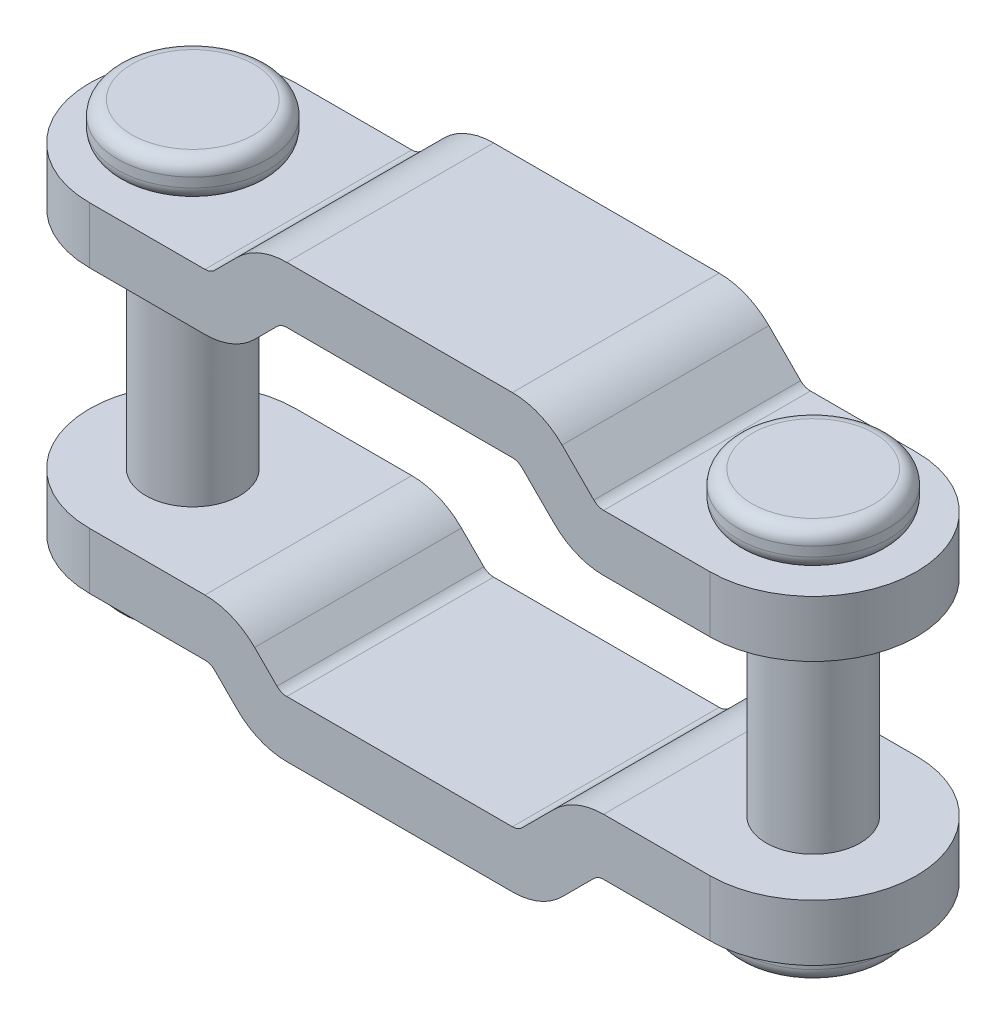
ISO-10303-21;
HEADER;
FILE_DESCRIPTION(('STEP AP214'),'2;1');
FILE_NAME('part.step','',(''),(''),'','','');
FILE_SCHEMA(('AUTOMOTIVE_DESIGN { 1 0 10303 214 1 1 1 1 }'));
ENDSEC;
DATA;
#1=APPLICATION_CONTEXT('core data for automotive mechanical design processes');
#2=APPLICATION_PROTOCOL_DEFINITION('international standard','automotive_design',2000,#1);
#3=PRODUCT_CONTEXT('',#1,'mechanical');
#4=PRODUCT('Part','Part','',(#3));
#5=PRODUCT_RELATED_PRODUCT_CATEGORY('part','',(#4));
#6=PRODUCT_DEFINITION_FORMATION('','',#4);
#7=PRODUCT_DEFINITION_CONTEXT('part definition',#1,'design');
#8=PRODUCT_DEFINITION('design','',#6,#7);
#9=PRODUCT_DEFINITION_SHAPE('','',#8);
#10=(LENGTH_UNIT() NAMED_UNIT(*) SI_UNIT(.MILLI.,.METRE.));
#11=(NAMED_UNIT(*) PLANE_ANGLE_UNIT() SI_UNIT($,.RADIAN.));
#12=(NAMED_UNIT(*) SI_UNIT($,.STERADIAN.) SOLID_ANGLE_UNIT());
#13=UNCERTAINTY_MEASURE_WITH_UNIT(LENGTH_MEASURE(1.E-05),#10,'distance_accuracy_value','');
#14=(GEOMETRIC_REPRESENTATION_CONTEXT(3) GLOBAL_UNCERTAINTY_ASSIGNED_CONTEXT((#13)) GLOBAL_UNIT_ASSIGNED_CONTEXT((#10,
#11,#12)) REPRESENTATION_CONTEXT('',''));
#15=CARTESIAN_POINT('',(0.,0.,0.));
#16=DIRECTION('',(0.,0.,1.));
#17=DIRECTION('',(1.,0.,0.));
#18=AXIS2_PLACEMENT_3D('',#15,#16,#17);
#19=CARTESIAN_POINT('',(33.,10.5,0.));
#20=DIRECTION('',(0.,-1.,0.));
#21=DIRECTION('',(0.999665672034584,0.,0.0258562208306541));
#22=AXIS2_PLACEMENT_3D('',#19,#20,#21);
#23=PLANE('',#22);
#24=CARTESIAN_POINT('',(33.,10.5,0.));
#25=DIRECTION('',(0.,-1.,0.));
#26=DIRECTION('',(0.999665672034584,0.,0.0258562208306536));
#27=AXIS2_PLACEMENT_3D('',#24,#25,#26);
#28=CIRCLE('',#27,3.2500000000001);
#29=CARTESIAN_POINT('',(36.2489134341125,10.5,0.0840327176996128));
#30=VERTEX_POINT('',#29);
#31=CARTESIAN_POINT('',(29.7510865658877,10.5,-0.0840327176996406));
#32=VERTEX_POINT('',#31);
#33=EDGE_CURVE('E811',#30,#32,#28,.T.);
#34=ORIENTED_EDGE('',*,*,#33,.F.);
#35=CARTESIAN_POINT('',(33.,10.5,0.));
#36=DIRECTION('',(0.,-1.,0.));
#37=DIRECTION('',(-0.999665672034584,0.,-0.0258562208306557));
#38=AXIS2_PLACEMENT_3D('',#35,#36,#37);
#39=CIRCLE('',#38,3.2500000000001);
#40=EDGE_CURVE('E1664',#32,#30,#39,.T.);
#41=ORIENTED_EDGE('',*,*,#40,.F.);
#42=EDGE_LOOP('',(#34,#41));
#43=FACE_BOUND('',#42,.T.);
#44=ADVANCED_FACE('F17',(#43),#23,.F.);
#45=CARTESIAN_POINT('',(0.,11.,0.));
#46=DIRECTION('',(0.,-1.,0.));
#47=DIRECTION('',(0.878973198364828,0.,0.47687117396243));
#48=AXIS2_PLACEMENT_3D('',#45,#46,#47);
#49=PLANE('',#48);
#50=CARTESIAN_POINT('',(0.,11.,0.));
#51=DIRECTION('',(0.,-1.,0.));
#52=DIRECTION('',(0.878973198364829,0.,0.476871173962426));
#53=AXIS2_PLACEMENT_3D('',#50,#51,#52);
#54=CIRCLE('',#53,3.25);
#55=CARTESIAN_POINT('',(2.8566628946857,11.,1.54983131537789));
#56=VERTEX_POINT('',#55);
#57=CARTESIAN_POINT('',(-2.85666289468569,11.,-1.54983131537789));
#58=VERTEX_POINT('',#57);
#59=EDGE_CURVE('E731',#56,#58,#54,.T.);
#60=ORIENTED_EDGE('',*,*,#59,.F.);
#61=CARTESIAN_POINT('',(0.,11.,0.));
#62=DIRECTION('',(0.,-1.,0.));
#63=DIRECTION('',(-0.878973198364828,0.,-0.476871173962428));
#64=AXIS2_PLACEMENT_3D('',#61,#62,#63);
#65=CIRCLE('',#64,3.25);
#66=EDGE_CURVE('E742',#58,#56,#65,.T.);
#67=ORIENTED_EDGE('',*,*,#66,.F.);
#68=EDGE_LOOP('',(#60,#67));
#69=FACE_BOUND('',#68,.T.);
#70=ADVANCED_FACE('F613',(#69),#49,.F.);
#71=CARTESIAN_POINT('',(33.,-10.5,0.));
#72=DIRECTION('',(0.,1.,0.));
#73=DIRECTION('',(-0.999665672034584,0.,-0.0258562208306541));
#74=AXIS2_PLACEMENT_3D('',#71,#72,#73);
#75=PLANE('',#74);
#76=CARTESIAN_POINT('',(33.,-10.5,0.));
#77=DIRECTION('',(0.,1.,0.));
#78=DIRECTION('',(-0.999665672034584,0.,-0.0258562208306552));
#79=AXIS2_PLACEMENT_3D('',#76,#77,#78);
#80=CIRCLE('',#79,3.2499999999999);
#81=CARTESIAN_POINT('',(29.7510865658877,-10.5,-0.0840327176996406));
#82=VERTEX_POINT('',#81);
#83=CARTESIAN_POINT('',(36.2489134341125,-10.5,0.0840327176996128));
#84=VERTEX_POINT('',#83);
#85=EDGE_CURVE('E1684',#82,#84,#80,.T.);
#86=ORIENTED_EDGE('',*,*,#85,.F.);
#87=CARTESIAN_POINT('',(33.,-10.5,0.));
#88=DIRECTION('',(0.,1.,0.));
#89=DIRECTION('',(0.999665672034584,0.,0.0258562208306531));
#90=AXIS2_PLACEMENT_3D('',#87,#88,#89);
#91=CIRCLE('',#90,3.2499999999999);
#92=EDGE_CURVE('E1685',#84,#82,#91,.T.);
#93=ORIENTED_EDGE('',*,*,#92,.F.);
#94=EDGE_LOOP('',(#86,#93));
#95=FACE_BOUND('',#94,.T.);
#96=ADVANCED_FACE('F628',(#95),#75,.F.);
#97=CARTESIAN_POINT('',(0.,-11.,0.));
#98=DIRECTION('',(0.,1.,0.));
#99=DIRECTION('',(-0.878973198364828,0.,-0.47687117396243));
#100=AXIS2_PLACEMENT_3D('',#97,#98,#99);
#101=PLANE('',#100);
#102=CARTESIAN_POINT('',(0.,-11.,0.));
#103=DIRECTION('',(0.,1.,0.));
#104=DIRECTION('',(-0.878973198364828,0.,-0.476871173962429));
#105=AXIS2_PLACEMENT_3D('',#102,#103,#104);
#106=CIRCLE('',#105,3.24999999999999);
#107=CARTESIAN_POINT('',(-2.85666289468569,-11.,-1.54983131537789));
#108=VERTEX_POINT('',#107);
#109=CARTESIAN_POINT('',(2.8566628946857,-11.,1.54983131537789));
#110=VERTEX_POINT('',#109);
#111=EDGE_CURVE('E699',#108,#110,#106,.T.);
#112=ORIENTED_EDGE('',*,*,#111,.F.);
#113=CARTESIAN_POINT('',(0.,-11.,0.));
#114=DIRECTION('',(0.,1.,0.));
#115=DIRECTION('',(0.878973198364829,0.,0.476871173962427));
#116=AXIS2_PLACEMENT_3D('',#113,#114,#115);
#117=CIRCLE('',#116,3.24999999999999);
#118=EDGE_CURVE('E695',#110,#108,#117,.T.);
#119=ORIENTED_EDGE('',*,*,#118,.F.);
#120=EDGE_LOOP('',(#112,#119));
#121=FACE_BOUND('',#120,.T.);
#122=ADVANCED_FACE('F637',(#121),#101,.F.);
#123=CARTESIAN_POINT('',(33.,9.75,0.));
#124=DIRECTION('',(0.,-1.,0.));
#125=DIRECTION('',(0.999665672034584,0.,0.0258562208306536));
#126=AXIS2_PLACEMENT_3D('',#123,#124,#125);
#127=TOROIDAL_SURFACE('',#126,3.2500000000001,0.75);
#128=ORIENTED_EDGE('',*,*,#33,.T.);
#129=ORIENTED_EDGE('',*,*,#40,.T.);
#130=EDGE_LOOP('',(#128,#129));
#131=FACE_BOUND('',#130,.T.);
#132=CARTESIAN_POINT('',(33.,9.75,0.));
#133=DIRECTION('',(0.,1.,0.));
#134=DIRECTION('',(-0.999665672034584,0.,-0.0258562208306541));
#135=AXIS2_PLACEMENT_3D('',#132,#133,#134);
#136=CIRCLE('',#135,4.);
#137=CARTESIAN_POINT('',(29.0013373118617,9.75,-0.10342488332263));
#138=VERTEX_POINT('',#137);
#139=EDGE_CURVE('E1688',#138,#138,#136,.F.);
#140=ORIENTED_EDGE('',*,*,#139,.F.);
#141=EDGE_LOOP('',(#140));
#142=FACE_BOUND('',#141,.T.);
#143=ADVANCED_FACE('F642',(#131,#142),#127,.T.);
#144=CARTESIAN_POINT('',(0.,10.25,0.));
#145=DIRECTION('',(0.,-1.,0.));
#146=DIRECTION('',(0.878973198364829,0.,0.476871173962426));
#147=AXIS2_PLACEMENT_3D('',#144,#145,#146);
#148=TOROIDAL_SURFACE('',#147,3.25,0.75);
#149=ORIENTED_EDGE('',*,*,#59,.T.);
#150=ORIENTED_EDGE('',*,*,#66,.T.);
#151=EDGE_LOOP('',(#149,#150));
#152=FACE_BOUND('',#151,.T.);
#153=CARTESIAN_POINT('',(0.,10.25,0.));
#154=DIRECTION('',(0.,1.,0.));
#155=DIRECTION('',(-0.878973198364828,0.,-0.47687117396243));
#156=AXIS2_PLACEMENT_3D('',#153,#154,#155);
#157=CIRCLE('',#156,4.);
#158=CARTESIAN_POINT('',(-3.51589279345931,10.25,-1.90748469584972));
#159=VERTEX_POINT('',#158);
#160=EDGE_CURVE('E690',#159,#159,#157,.F.);
#161=ORIENTED_EDGE('',*,*,#160,.F.);
#162=EDGE_LOOP('',(#161));
#163=FACE_BOUND('',#162,.T.);
#164=ADVANCED_FACE('F631',(#152,#163),#148,.T.);
#165=CARTESIAN_POINT('',(33.,-9.75,0.));
#166=DIRECTION('',(0.,1.,0.));
#167=DIRECTION('',(-0.999665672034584,0.,-0.0258562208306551));
#168=AXIS2_PLACEMENT_3D('',#165,#166,#167);
#169=TOROIDAL_SURFACE('',#168,3.2499999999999,0.75);
#170=ORIENTED_EDGE('',*,*,#85,.T.);
#171=ORIENTED_EDGE('',*,*,#92,.T.);
#172=EDGE_LOOP('',(#170,#171));
#173=FACE_BOUND('',#172,.T.);
#174=CARTESIAN_POINT('',(33.,-9.75,0.));
#175=DIRECTION('',(0.,-1.,0.));
#176=DIRECTION('',(0.999665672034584,0.,0.0258562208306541));
#177=AXIS2_PLACEMENT_3D('',#174,#175,#176);
#178=CIRCLE('',#177,4.);
#179=CARTESIAN_POINT('',(36.9986626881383,-9.75,0.103424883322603));
#180=VERTEX_POINT('',#179);
#181=EDGE_CURVE('E1603',#180,#180,#178,.F.);
#182=ORIENTED_EDGE('',*,*,#181,.F.);
#183=EDGE_LOOP('',(#182));
#184=FACE_BOUND('',#183,.T.);
#185=ADVANCED_FACE('F640',(#173,#184),#169,.T.);
#186=CARTESIAN_POINT('',(0.,-10.25,0.));
#187=DIRECTION('',(0.,1.,0.));
#188=DIRECTION('',(-0.878973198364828,0.,-0.476871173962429));
#189=AXIS2_PLACEMENT_3D('',#186,#187,#188);
#190=TOROIDAL_SURFACE('',#189,3.24999999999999,0.75);
#191=ORIENTED_EDGE('',*,*,#111,.T.);
#192=ORIENTED_EDGE('',*,*,#118,.T.);
#193=EDGE_LOOP('',(#191,#192));
#194=FACE_BOUND('',#193,.T.);
#195=CARTESIAN_POINT('',(0.,-10.25,0.));
#196=DIRECTION('',(0.,-1.,0.));
#197=DIRECTION('',(0.878973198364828,0.,0.47687117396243));
#198=AXIS2_PLACEMENT_3D('',#195,#196,#197);
#199=CIRCLE('',#198,4.);
#200=CARTESIAN_POINT('',(3.51589279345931,-10.25,1.90748469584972));
#201=VERTEX_POINT('',#200);
#202=EDGE_CURVE('E688',#201,#201,#199,.F.);
#203=ORIENTED_EDGE('',*,*,#202,.F.);
#204=EDGE_LOOP('',(#203));
#205=FACE_BOUND('',#204,.T.);
#206=ADVANCED_FACE('F624',(#194,#205),#190,.T.);
#207=CARTESIAN_POINT('',(33.,8.5,0.));
#208=DIRECTION('',(0.,1.,0.));
#209=DIRECTION('',(-0.999665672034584,0.,-0.0258562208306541));
#210=AXIS2_PLACEMENT_3D('',#207,#208,#209);
#211=CYLINDRICAL_SURFACE('',#210,4.);
#212=CARTESIAN_POINT('',(33.,9.25,0.));
#213=DIRECTION('',(0.,-1.,0.));
#214=DIRECTION('',(0.999665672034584,0.,0.0258562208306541));
#215=AXIS2_PLACEMENT_3D('',#212,#213,#214);
#216=CIRCLE('',#215,4.);
#217=CARTESIAN_POINT('',(36.9986626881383,9.25,0.103424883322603));
#218=VERTEX_POINT('',#217);
#219=EDGE_CURVE('E1601',#218,#218,#216,.T.);
#220=ORIENTED_EDGE('',*,*,#219,.F.);
#221=EDGE_LOOP('',(#220));
#222=FACE_BOUND('',#221,.T.);
#223=ORIENTED_EDGE('',*,*,#139,.T.);
#224=EDGE_LOOP('',(#223));
#225=FACE_BOUND('',#224,.T.);
#226=ADVANCED_FACE('F658',(#222,#225),#211,.T.);
#227=CARTESIAN_POINT('',(0.,9.,0.));
#228=DIRECTION('',(0.,1.,0.));
#229=DIRECTION('',(-0.878973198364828,0.,-0.47687117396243));
#230=AXIS2_PLACEMENT_3D('',#227,#228,#229);
#231=CYLINDRICAL_SURFACE('',#230,4.);
#232=CARTESIAN_POINT('',(0.,9.75,0.));
#233=DIRECTION('',(0.,-1.,0.));
#234=DIRECTION('',(0.878973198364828,0.,0.47687117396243));
#235=AXIS2_PLACEMENT_3D('',#232,#233,#234);
#236=CIRCLE('',#235,4.);
#237=CARTESIAN_POINT('',(3.51589279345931,9.75,1.90748469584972));
#238=VERTEX_POINT('',#237);
#239=EDGE_CURVE('E686',#238,#238,#236,.T.);
#240=ORIENTED_EDGE('',*,*,#239,.F.);
#241=EDGE_LOOP('',(#240));
#242=FACE_BOUND('',#241,.T.);
#243=ORIENTED_EDGE('',*,*,#160,.T.);
#244=EDGE_LOOP('',(#243));
#245=FACE_BOUND('',#244,.T.);
#246=ADVANCED_FACE('F593',(#242,#245),#231,.T.);
#247=CARTESIAN_POINT('',(33.,-8.5,0.));
#248=DIRECTION('',(0.,-1.,0.));
#249=DIRECTION('',(0.999665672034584,0.,0.0258562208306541));
#250=AXIS2_PLACEMENT_3D('',#247,#248,#249);
#251=CYLINDRICAL_SURFACE('',#250,4.);
#252=CARTESIAN_POINT('',(33.,-9.25,0.));
#253=DIRECTION('',(0.,1.,0.));
#254=DIRECTION('',(-0.999665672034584,0.,-0.0258562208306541));
#255=AXIS2_PLACEMENT_3D('',#252,#253,#254);
#256=CIRCLE('',#255,4.);
#257=CARTESIAN_POINT('',(29.0013373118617,-9.25,-0.10342488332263));
#258=VERTEX_POINT('',#257);
#259=EDGE_CURVE('E1592',#258,#258,#256,.T.);
#260=ORIENTED_EDGE('',*,*,#259,.F.);
#261=EDGE_LOOP('',(#260));
#262=FACE_BOUND('',#261,.T.);
#263=ORIENTED_EDGE('',*,*,#181,.T.);
#264=EDGE_LOOP('',(#263));
#265=FACE_BOUND('',#264,.T.);
#266=ADVANCED_FACE('F621',(#262,#265),#251,.T.);
#267=CARTESIAN_POINT('',(0.,-9.,0.));
#268=DIRECTION('',(0.,-1.,0.));
#269=DIRECTION('',(0.878973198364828,0.,0.47687117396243));
#270=AXIS2_PLACEMENT_3D('',#267,#268,#269);
#271=CYLINDRICAL_SURFACE('',#270,4.);
#272=CARTESIAN_POINT('',(0.,-9.75,0.));
#273=DIRECTION('',(0.,1.,0.));
#274=DIRECTION('',(-0.878973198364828,0.,-0.47687117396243));
#275=AXIS2_PLACEMENT_3D('',#272,#273,#274);
#276=CIRCLE('',#275,4.);
#277=CARTESIAN_POINT('',(-3.51589279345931,-9.75,-1.90748469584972));
#278=VERTEX_POINT('',#277);
#279=EDGE_CURVE('E797',#278,#278,#276,.T.);
#280=ORIENTED_EDGE('',*,*,#279,.F.);
#281=EDGE_LOOP('',(#280));
#282=FACE_BOUND('',#281,.T.);
#283=ORIENTED_EDGE('',*,*,#202,.T.);
#284=EDGE_LOOP('',(#283));
#285=FACE_BOUND('',#284,.T.);
#286=ADVANCED_FACE('F610',(#282,#285),#271,.T.);
#287=CARTESIAN_POINT('',(33.,8.5,0.));
#288=DIRECTION('',(0.,-1.,0.));
#289=DIRECTION('',(0.999665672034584,0.,0.0258562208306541));
#290=AXIS2_PLACEMENT_3D('',#287,#288,#289);
#291=CYLINDRICAL_SURFACE('',#290,2.5);
#292=CARTESIAN_POINT('',(33.,-5.5,0.));
#293=DIRECTION('',(0.,-1.,0.));
#294=DIRECTION('',(-0.0258562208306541,0.,0.999665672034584));
#295=AXIS2_PLACEMENT_3D('',#292,#293,#294);
#296=CIRCLE('',#295,2.5);
#297=CARTESIAN_POINT('',(32.9353594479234,-5.5,2.49916418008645));
#298=VERTEX_POINT('',#297);
#299=EDGE_CURVE('E29',#298,#298,#296,.F.);
#300=ORIENTED_EDGE('',*,*,#299,.T.);
#301=EDGE_LOOP('',(#300));
#302=FACE_BOUND('',#301,.T.);
#303=CARTESIAN_POINT('',(33.,5.5,0.));
#304=DIRECTION('',(0.,1.,0.));
#305=DIRECTION('',(0.0258562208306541,0.,-0.999665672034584));
#306=AXIS2_PLACEMENT_3D('',#303,#304,#305);
#307=CIRCLE('',#306,2.5);
#308=CARTESIAN_POINT('',(33.0646405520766,5.5,-2.49916418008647));
#309=VERTEX_POINT('',#308);
#310=EDGE_CURVE('E11',#309,#309,#307,.F.);
#311=ORIENTED_EDGE('',*,*,#310,.T.);
#312=EDGE_LOOP('',(#311));
#313=FACE_BOUND('',#312,.T.);
#314=ADVANCED_FACE('F600',(#302,#313),#291,.T.);
#315=CARTESIAN_POINT('',(33.,-9.25,0.));
#316=DIRECTION('',(0.,1.,0.));
#317=DIRECTION('',(-0.999665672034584,0.,-0.0258562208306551));
#318=AXIS2_PLACEMENT_3D('',#315,#316,#317);
#319=TOROIDAL_SURFACE('',#318,3.2499999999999,0.75);
#320=ORIENTED_EDGE('',*,*,#259,.T.);
#321=EDGE_LOOP('',(#320));
#322=FACE_BOUND('',#321,.T.);
#323=CARTESIAN_POINT('',(33.,-8.5,0.));
#324=DIRECTION('',(0.,-1.,0.));
#325=DIRECTION('',(-0.999665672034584,0.,-0.025856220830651));
#326=AXIS2_PLACEMENT_3D('',#323,#324,#325);
#327=CIRCLE('',#326,3.2499999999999);
#328=CARTESIAN_POINT('',(36.2489134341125,-8.5,0.0840327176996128));
#329=VERTEX_POINT('',#328);
#330=CARTESIAN_POINT('',(29.7510865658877,-8.5,-0.0840327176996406));
#331=VERTEX_POINT('',#330);
#332=EDGE_CURVE('E37',#329,#331,#327,.F.);
#333=ORIENTED_EDGE('',*,*,#332,.F.);
#334=CARTESIAN_POINT('',(33.,-8.5,0.));
#335=DIRECTION('',(0.,-1.,0.));
#336=DIRECTION('',(0.999665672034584,0.,0.0258562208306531));
#337=AXIS2_PLACEMENT_3D('',#334,#335,#336);
#338=CIRCLE('',#337,3.2499999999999);
#339=EDGE_CURVE('E487',#331,#329,#338,.F.);
#340=ORIENTED_EDGE('',*,*,#339,.F.);
#341=EDGE_LOOP('',(#333,#340));
#342=FACE_BOUND('',#341,.T.);
#343=ADVANCED_FACE('F609',(#322,#342),#319,.T.);
#344=CARTESIAN_POINT('',(0.,-9.75,0.));
#345=DIRECTION('',(0.,1.,0.));
#346=DIRECTION('',(-0.878973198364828,0.,-0.476871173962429));
#347=AXIS2_PLACEMENT_3D('',#344,#345,#346);
#348=TOROIDAL_SURFACE('',#347,3.24999999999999,0.75);
#349=ORIENTED_EDGE('',*,*,#279,.T.);
#350=EDGE_LOOP('',(#349));
#351=FACE_BOUND('',#350,.T.);
#352=CARTESIAN_POINT('',(0.,-9.,0.));
#353=DIRECTION('',(0.,-1.,0.));
#354=DIRECTION('',(-0.87897319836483,0.,-0.476871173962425));
#355=AXIS2_PLACEMENT_3D('',#352,#353,#354);
#356=CIRCLE('',#355,3.24999999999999);
#357=CARTESIAN_POINT('',(2.8566628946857,-9.,1.54983131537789));
#358=VERTEX_POINT('',#357);
#359=CARTESIAN_POINT('',(-2.85666289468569,-9.,-1.54983131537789));
#360=VERTEX_POINT('',#359);
#361=EDGE_CURVE('E443',#358,#360,#356,.F.);
#362=ORIENTED_EDGE('',*,*,#361,.F.);
#363=CARTESIAN_POINT('',(0.,-9.,0.));
#364=DIRECTION('',(0.,-1.,0.));
#365=DIRECTION('',(0.878973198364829,0.,0.476871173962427));
#366=AXIS2_PLACEMENT_3D('',#363,#364,#365);
#367=CIRCLE('',#366,3.24999999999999);
#368=EDGE_CURVE('E762',#360,#358,#367,.F.);
#369=ORIENTED_EDGE('',*,*,#368,.F.);
#370=EDGE_LOOP('',(#362,#369));
#371=FACE_BOUND('',#370,.T.);
#372=ADVANCED_FACE('F592',(#351,#371),#348,.T.);
#373=CARTESIAN_POINT('',(22.5,-7.7634,-11.5362783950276));
#374=DIRECTION('',(0.,0.,1.));
#375=DIRECTION('',(1.,0.,0.));
#376=AXIS2_PLACEMENT_3D('',#373,#374,#375);
#377=CYLINDRICAL_SURFACE('',#376,0.7366);
#378=DIRECTION('',(0.,0.,1.));
#379=VECTOR('',#378,1.);
#380=CARTESIAN_POINT('',(23.0208548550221,-8.28425485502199,-11.5362783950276));
#381=LINE('',#380,#379);
#382=CARTESIAN_POINT('',(23.0208548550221,-8.28425485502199,-5.5));
#383=VERTEX_POINT('',#382);
#384=CARTESIAN_POINT('',(23.0208548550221,-8.28425485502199,5.5));
#385=VERTEX_POINT('',#384);
#386=EDGE_CURVE('E821',#383,#385,#381,.T.);
#387=ORIENTED_EDGE('',*,*,#386,.F.);
#388=CARTESIAN_POINT('',(22.5,-7.7634,-5.5));
#389=DIRECTION('',(0.,0.,1.));
#390=DIRECTION('',(1.,0.,0.));
#391=AXIS2_PLACEMENT_3D('',#388,#389,#390);
#392=CIRCLE('',#391,0.7366);
#393=CARTESIAN_POINT('',(22.5,-8.5,-5.5));
#394=VERTEX_POINT('',#393);
#395=EDGE_CURVE('E845',#394,#383,#392,.T.);
#396=ORIENTED_EDGE('',*,*,#395,.F.);
#397=DIRECTION('',(0.,0.,-1.));
#398=VECTOR('',#397,1.);
#399=CARTESIAN_POINT('',(22.5,-8.5,5.5));
#400=LINE('',#399,#398);
#401=CARTESIAN_POINT('',(22.5,-8.5,5.5));
#402=VERTEX_POINT('',#401);
#403=EDGE_CURVE('E826',#394,#402,#400,.F.);
#404=ORIENTED_EDGE('',*,*,#403,.T.);
#405=CARTESIAN_POINT('',(22.5,-7.7634,5.5));
#406=DIRECTION('',(0.,0.,1.));
#407=DIRECTION('',(1.,0.,0.));
#408=AXIS2_PLACEMENT_3D('',#405,#406,#407);
#409=CIRCLE('',#408,0.7366);
#410=EDGE_CURVE('E950',#385,#402,#409,.F.);
#411=ORIENTED_EDGE('',*,*,#410,.F.);
#412=EDGE_LOOP('',(#387,#396,#404,#411));
#413=FACE_BOUND('',#412,.T.);
#414=ADVANCED_FACE('F775',(#413),#377,.F.);
#415=CARTESIAN_POINT('',(-0.141574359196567,-31.4466840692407,5.5));
#416=DIRECTION('',(0.707106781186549,-0.707106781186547,0.));
#417=DIRECTION('',(-0.707106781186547,-0.707106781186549,0.));
#418=AXIS2_PLACEMENT_3D('',#415,#416,#417);
#419=PLANE('',#418);
#420=DIRECTION('',(-0.707106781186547,-0.707106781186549,0.));
#421=VECTOR('',#420,1.);
#422=CARTESIAN_POINT('',(-0.141574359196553,-31.4466840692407,-5.5));
#423=LINE('',#422,#421);
#424=CARTESIAN_POINT('',(24.7106849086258,-6.59442480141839,-5.5));
#425=VERTEX_POINT('',#424);
#426=EDGE_CURVE('E861',#383,#425,#423,.F.);
#427=ORIENTED_EDGE('',*,*,#426,.F.);
#428=ORIENTED_EDGE('',*,*,#386,.T.);
#429=DIRECTION('',(-0.707106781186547,-0.707106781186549,0.));
#430=VECTOR('',#429,1.);
#431=CARTESIAN_POINT('',(-0.141574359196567,-31.4466840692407,5.5));
#432=LINE('',#431,#430);
#433=CARTESIAN_POINT('',(24.7106849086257,-6.59442480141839,5.5));
#434=VERTEX_POINT('',#433);
#435=EDGE_CURVE('E864',#434,#385,#432,.T.);
#436=ORIENTED_EDGE('',*,*,#435,.F.);
#437=DIRECTION('',(0.,0.,-1.));
#438=VECTOR('',#437,1.);
#439=CARTESIAN_POINT('',(24.7106849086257,-6.59442480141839,5.5));
#440=LINE('',#439,#438);
#441=EDGE_CURVE('E851',#425,#434,#440,.F.);
#442=ORIENTED_EDGE('',*,*,#441,.F.);
#443=EDGE_LOOP('',(#427,#428,#436,#442));
#444=FACE_BOUND('',#443,.T.);
#445=ADVANCED_FACE('F1147',(#444),#419,.F.);
#446=CARTESIAN_POINT('',(27.3528601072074,-9.2366,-11.9843835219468));
#447=DIRECTION('',(0.,0.,1.));
#448=DIRECTION('',(1.,0.,0.));
#449=AXIS2_PLACEMENT_3D('',#446,#447,#448);
#450=CYLINDRICAL_SURFACE('',#449,3.7366);
#451=CARTESIAN_POINT('',(27.3528601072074,-9.2366,-5.5));
#452=DIRECTION('',(0.,0.,1.));
#453=DIRECTION('',(1.,0.,0.));
#454=AXIS2_PLACEMENT_3D('',#451,#452,#453);
#455=CIRCLE('',#454,3.7366);
#456=CARTESIAN_POINT('',(27.3528601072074,-5.5,-5.5));
#457=VERTEX_POINT('',#456);
#458=EDGE_CURVE('E885',#457,#425,#455,.T.);
#459=ORIENTED_EDGE('',*,*,#458,.T.);
#460=ORIENTED_EDGE('',*,*,#441,.T.);
#461=CARTESIAN_POINT('',(27.3528601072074,-9.2366,5.5));
#462=DIRECTION('',(0.,0.,1.));
#463=DIRECTION('',(1.,0.,0.));
#464=AXIS2_PLACEMENT_3D('',#461,#462,#463);
#465=CIRCLE('',#464,3.7366);
#466=CARTESIAN_POINT('',(27.3528601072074,-5.5,5.5));
#467=VERTEX_POINT('',#466);
#468=EDGE_CURVE('E868',#434,#467,#465,.F.);
#469=ORIENTED_EDGE('',*,*,#468,.T.);
#470=DIRECTION('',(0.,0.,1.));
#471=VECTOR('',#470,1.);
#472=CARTESIAN_POINT('',(27.3528601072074,-5.5,-11.9843835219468));
#473=LINE('',#472,#471);
#474=EDGE_CURVE('E882',#467,#457,#473,.F.);
#475=ORIENTED_EDGE('',*,*,#474,.T.);
#476=EDGE_LOOP('',(#459,#460,#469,#475));
#477=FACE_BOUND('',#476,.T.);
#478=ADVANCED_FACE('F1141',(#477),#450,.T.);
#479=CARTESIAN_POINT('',(-9.55016353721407,-5.5,5.5));
#480=DIRECTION('',(0.,-1.,0.));
#481=DIRECTION('',(0.,0.,-1.));
#482=AXIS2_PLACEMENT_3D('',#479,#480,#481);
#483=PLANE('',#482);
#484=CARTESIAN_POINT('',(33.,-5.5,0.));
#485=DIRECTION('',(0.,1.,0.));
#486=DIRECTION('',(1.,0.,0.));
#487=AXIS2_PLACEMENT_3D('',#484,#485,#486);
#488=CIRCLE('',#487,5.5);
#489=CARTESIAN_POINT('',(33.,-5.5,-5.5));
#490=VERTEX_POINT('',#489);
#491=CARTESIAN_POINT('',(33.,-5.5,5.5));
#492=VERTEX_POINT('',#491);
#493=EDGE_CURVE('E890',#490,#492,#488,.F.);
#494=ORIENTED_EDGE('',*,*,#493,.F.);
#495=DIRECTION('',(1.,0.,0.));
#496=VECTOR('',#495,1.);
#497=CARTESIAN_POINT('',(-9.55016353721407,-5.5,-5.5));
#498=LINE('',#497,#496);
#499=EDGE_CURVE('E891',#457,#490,#498,.T.);
#500=ORIENTED_EDGE('',*,*,#499,.F.);
#501=ORIENTED_EDGE('',*,*,#474,.F.);
#502=DIRECTION('',(1.,0.,0.));
#503=VECTOR('',#502,1.);
#504=CARTESIAN_POINT('',(-9.55016353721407,-5.5,5.5));
#505=LINE('',#504,#503);
#506=EDGE_CURVE('E877',#492,#467,#505,.F.);
#507=ORIENTED_EDGE('',*,*,#506,.F.);
#508=EDGE_LOOP('',(#494,#500,#501,#507));
#509=FACE_BOUND('',#508,.T.);
#510=ORIENTED_EDGE('',*,*,#299,.F.);
#511=EDGE_LOOP('',(#510));
#512=FACE_BOUND('',#511,.T.);
#513=ADVANCED_FACE('F1137',(#509,#512),#483,.F.);
#514=CARTESIAN_POINT('',(33.,-5.5,0.));
#515=DIRECTION('',(0.,1.,0.));
#516=DIRECTION('',(1.,0.,0.));
#517=AXIS2_PLACEMENT_3D('',#514,#515,#516);
#518=CYLINDRICAL_SURFACE('',#517,5.5);
#519=ORIENTED_EDGE('',*,*,#493,.T.);
#520=DIRECTION('',(0.,-1.,0.));
#521=VECTOR('',#520,1.);
#522=CARTESIAN_POINT('',(33.,-8.5,5.5));
#523=LINE('',#522,#521);
#524=CARTESIAN_POINT('',(33.,-8.5,5.5));
#525=VERTEX_POINT('',#524);
#526=EDGE_CURVE('E915',#525,#492,#523,.F.);
#527=ORIENTED_EDGE('',*,*,#526,.F.);
#528=CARTESIAN_POINT('',(33.,-8.5,0.));
#529=DIRECTION('',(0.,1.,0.));
#530=DIRECTION('',(1.,0.,0.));
#531=AXIS2_PLACEMENT_3D('',#528,#529,#530);
#532=CIRCLE('',#531,5.5);
#533=CARTESIAN_POINT('',(33.,-8.5,-5.5));
#534=VERTEX_POINT('',#533);
#535=EDGE_CURVE('E921',#525,#534,#532,.T.);
#536=ORIENTED_EDGE('',*,*,#535,.T.);
#537=DIRECTION('',(0.,1.,0.));
#538=VECTOR('',#537,1.);
#539=CARTESIAN_POINT('',(33.,-8.5,-5.5));
#540=LINE('',#539,#538);
#541=EDGE_CURVE('E914',#490,#534,#540,.F.);
#542=ORIENTED_EDGE('',*,*,#541,.F.);
#543=EDGE_LOOP('',(#519,#527,#536,#542));
#544=FACE_BOUND('',#543,.T.);
#545=ADVANCED_FACE('F1132',(#544),#518,.T.);
#546=CARTESIAN_POINT('',(-9.55016353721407,-8.5,5.5));
#547=DIRECTION('',(0.,-1.,0.));
#548=DIRECTION('',(0.,0.,-1.));
#549=AXIS2_PLACEMENT_3D('',#546,#547,#548);
#550=PLANE('',#549);
#551=ORIENTED_EDGE('',*,*,#332,.T.);
#552=ORIENTED_EDGE('',*,*,#339,.T.);
#553=EDGE_LOOP('',(#551,#552));
#554=FACE_BOUND('',#553,.T.);
#555=DIRECTION('',(1.,0.,0.));
#556=VECTOR('',#555,1.);
#557=CARTESIAN_POINT('',(-9.55016353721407,-8.5,5.5));
#558=LINE('',#557,#556);
#559=CARTESIAN_POINT('',(27.3528601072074,-8.5,5.5));
#560=VERTEX_POINT('',#559);
#561=EDGE_CURVE('E917',#560,#525,#558,.T.);
#562=ORIENTED_EDGE('',*,*,#561,.F.);
#563=DIRECTION('',(0.,0.,1.));
#564=VECTOR('',#563,1.);
#565=CARTESIAN_POINT('',(27.3528601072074,-8.5,-11.9843835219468));
#566=LINE('',#565,#564);
#567=CARTESIAN_POINT('',(27.3528601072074,-8.5,-5.5));
#568=VERTEX_POINT('',#567);
#569=EDGE_CURVE('E929',#560,#568,#566,.F.);
#570=ORIENTED_EDGE('',*,*,#569,.T.);
#571=DIRECTION('',(1.,0.,0.));
#572=VECTOR('',#571,1.);
#573=CARTESIAN_POINT('',(-9.55016353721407,-8.5,-5.5));
#574=LINE('',#573,#572);
#575=EDGE_CURVE('E911',#534,#568,#574,.F.);
#576=ORIENTED_EDGE('',*,*,#575,.F.);
#577=ORIENTED_EDGE('',*,*,#535,.F.);
#578=EDGE_LOOP('',(#562,#570,#576,#577));
#579=FACE_BOUND('',#578,.T.);
#580=ADVANCED_FACE('F463',(#554,#579),#550,.T.);
#581=CARTESIAN_POINT('',(27.3528601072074,-9.2366,-11.9843835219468));
#582=DIRECTION('',(0.,0.,1.));
#583=DIRECTION('',(1.,0.,0.));
#584=AXIS2_PLACEMENT_3D('',#581,#582,#583);
#585=CYLINDRICAL_SURFACE('',#584,0.7366);
#586=DIRECTION('',(0.,0.,-1.));
#587=VECTOR('',#586,1.);
#588=CARTESIAN_POINT('',(26.8320052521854,-8.71574514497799,5.5));
#589=LINE('',#588,#587);
#590=CARTESIAN_POINT('',(26.8320052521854,-8.71574514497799,-5.5));
#591=VERTEX_POINT('',#590);
#592=CARTESIAN_POINT('',(26.8320052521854,-8.71574514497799,5.5));
#593=VERTEX_POINT('',#592);
#594=EDGE_CURVE('E894',#591,#593,#589,.F.);
#595=ORIENTED_EDGE('',*,*,#594,.F.);
#596=CARTESIAN_POINT('',(27.3528601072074,-9.2366,-5.5));
#597=DIRECTION('',(0.,0.,1.));
#598=DIRECTION('',(1.,0.,0.));
#599=AXIS2_PLACEMENT_3D('',#596,#597,#598);
#600=CIRCLE('',#599,0.7366);
#601=EDGE_CURVE('E938',#568,#591,#600,.T.);
#602=ORIENTED_EDGE('',*,*,#601,.F.);
#603=ORIENTED_EDGE('',*,*,#569,.F.);
#604=CARTESIAN_POINT('',(27.3528601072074,-9.2366,5.5));
#605=DIRECTION('',(0.,0.,1.));
#606=DIRECTION('',(1.,0.,0.));
#607=AXIS2_PLACEMENT_3D('',#604,#605,#606);
#608=CIRCLE('',#607,0.7366);
#609=EDGE_CURVE('E966',#593,#560,#608,.F.);
#610=ORIENTED_EDGE('',*,*,#609,.F.);
#611=EDGE_LOOP('',(#595,#602,#603,#610));
#612=FACE_BOUND('',#611,.T.);
#613=ADVANCED_FACE('F1126',(#612),#585,.F.);
#614=CARTESIAN_POINT('',(1.97974598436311,-33.5680044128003,5.5));
#615=DIRECTION('',(0.707106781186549,-0.707106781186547,0.));
#616=DIRECTION('',(-0.707106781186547,-0.707106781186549,0.));
#617=AXIS2_PLACEMENT_3D('',#614,#615,#616);
#618=PLANE('',#617);
#619=DIRECTION('',(0.707106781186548,0.707106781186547,0.));
#620=VECTOR('',#619,1.);
#621=CARTESIAN_POINT('',(25.1421751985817,-10.4055751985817,5.5));
#622=LINE('',#621,#620);
#623=CARTESIAN_POINT('',(25.1421751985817,-10.4055751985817,5.5));
#624=VERTEX_POINT('',#623);
#625=EDGE_CURVE('E854',#624,#593,#622,.T.);
#626=ORIENTED_EDGE('',*,*,#625,.F.);
#627=DIRECTION('',(0.,0.,1.));
#628=VECTOR('',#627,1.);
#629=CARTESIAN_POINT('',(25.1421751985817,-10.4055751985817,-11.5362783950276));
#630=LINE('',#629,#628);
#631=CARTESIAN_POINT('',(25.1421751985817,-10.4055751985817,-5.5));
#632=VERTEX_POINT('',#631);
#633=EDGE_CURVE('E858',#632,#624,#630,.T.);
#634=ORIENTED_EDGE('',*,*,#633,.F.);
#635=DIRECTION('',(-0.707106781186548,-0.707106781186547,0.));
#636=VECTOR('',#635,1.);
#637=CARTESIAN_POINT('',(26.8320052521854,-8.71574514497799,-5.5));
#638=LINE('',#637,#636);
#639=EDGE_CURVE('E866',#591,#632,#638,.T.);
#640=ORIENTED_EDGE('',*,*,#639,.F.);
#641=ORIENTED_EDGE('',*,*,#594,.T.);
#642=EDGE_LOOP('',(#626,#634,#640,#641));
#643=FACE_BOUND('',#642,.T.);
#644=ADVANCED_FACE('F1121',(#643),#618,.T.);
#645=CARTESIAN_POINT('',(22.5,-7.7634,-11.5362783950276));
#646=DIRECTION('',(0.,0.,1.));
#647=DIRECTION('',(1.,0.,0.));
#648=AXIS2_PLACEMENT_3D('',#645,#646,#647);
#649=CYLINDRICAL_SURFACE('',#648,3.7366);
#650=CARTESIAN_POINT('',(22.5,-7.7634,-5.5));
#651=DIRECTION('',(0.,0.,1.));
#652=DIRECTION('',(1.,0.,0.));
#653=AXIS2_PLACEMENT_3D('',#650,#651,#652);
#654=CIRCLE('',#653,3.7366);
#655=CARTESIAN_POINT('',(22.5,-11.5,-5.5));
#656=VERTEX_POINT('',#655);
#657=EDGE_CURVE('E836',#632,#656,#654,.F.);
#658=ORIENTED_EDGE('',*,*,#657,.F.);
#659=ORIENTED_EDGE('',*,*,#633,.T.);
#660=CARTESIAN_POINT('',(22.5,-7.7634,5.5));
#661=DIRECTION('',(0.,0.,1.));
#662=DIRECTION('',(1.,0.,0.));
#663=AXIS2_PLACEMENT_3D('',#660,#661,#662);
#664=CIRCLE('',#663,3.7366);
#665=CARTESIAN_POINT('',(22.5,-11.5,5.5));
#666=VERTEX_POINT('',#665);
#667=EDGE_CURVE('E947',#666,#624,#664,.T.);
#668=ORIENTED_EDGE('',*,*,#667,.F.);
#669=DIRECTION('',(0.,0.,-1.));
#670=VECTOR('',#669,1.);
#671=CARTESIAN_POINT('',(22.5,-11.5,5.5));
#672=LINE('',#671,#670);
#673=EDGE_CURVE('E834',#656,#666,#672,.F.);
#674=ORIENTED_EDGE('',*,*,#673,.F.);
#675=EDGE_LOOP('',(#658,#659,#668,#674));
#676=FACE_BOUND('',#675,.T.);
#677=ADVANCED_FACE('F1116',(#676),#649,.T.);
#678=CARTESIAN_POINT('',(-8.5,-11.5,5.5));
#679=DIRECTION('',(0.,-1.,0.));
#680=DIRECTION('',(-1.,0.,0.));
#681=AXIS2_PLACEMENT_3D('',#678,#679,#680);
#682=PLANE('',#681);
#683=DIRECTION('',(1.,0.,0.));
#684=VECTOR('',#683,1.);
#685=CARTESIAN_POINT('',(-8.5,-11.5,5.5));
#686=LINE('',#685,#684);
#687=CARTESIAN_POINT('',(10.5,-11.5,5.5));
#688=VERTEX_POINT('',#687);
#689=EDGE_CURVE('E842',#688,#666,#686,.T.);
#690=ORIENTED_EDGE('',*,*,#689,.F.);
#691=DIRECTION('',(0.,0.,-1.));
#692=VECTOR('',#691,1.);
#693=CARTESIAN_POINT('',(10.5,-11.5,5.5));
#694=LINE('',#693,#692);
#695=CARTESIAN_POINT('',(10.5,-11.5,-5.5));
#696=VERTEX_POINT('',#695);
#697=EDGE_CURVE('E831',#688,#696,#694,.T.);
#698=ORIENTED_EDGE('',*,*,#697,.T.);
#699=DIRECTION('',(1.,0.,0.));
#700=VECTOR('',#699,1.);
#701=CARTESIAN_POINT('',(-8.5,-11.5,-5.5));
#702=LINE('',#701,#700);
#703=EDGE_CURVE('E818',#656,#696,#702,.F.);
#704=ORIENTED_EDGE('',*,*,#703,.F.);
#705=ORIENTED_EDGE('',*,*,#673,.T.);
#706=EDGE_LOOP('',(#690,#698,#704,#705));
#707=FACE_BOUND('',#706,.T.);
#708=ADVANCED_FACE('F1111',(#707),#682,.T.);
#709=CARTESIAN_POINT('',(10.5,-7.7634,11.5362783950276));
#710=DIRECTION('',(0.,0.,-1.));
#711=DIRECTION('',(0.,1.,0.));
#712=AXIS2_PLACEMENT_3D('',#709,#710,#711);
#713=CYLINDRICAL_SURFACE('',#712,3.7366);
#714=DIRECTION('',(0.,0.,-1.));
#715=VECTOR('',#714,1.);
#716=CARTESIAN_POINT('',(7.85782480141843,-10.4055751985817,11.5362783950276));
#717=LINE('',#716,#715);
#718=CARTESIAN_POINT('',(7.85782480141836,-10.4055751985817,5.5));
#719=VERTEX_POINT('',#718);
#720=CARTESIAN_POINT('',(7.85782480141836,-10.4055751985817,-5.5));
#721=VERTEX_POINT('',#720);
#722=EDGE_CURVE('E852',#719,#721,#717,.T.);
#723=ORIENTED_EDGE('',*,*,#722,.T.);
#724=CARTESIAN_POINT('',(10.5,-7.7634,-5.5));
#725=DIRECTION('',(0.,0.,-1.));
#726=DIRECTION('',(0.,1.,0.));
#727=AXIS2_PLACEMENT_3D('',#724,#725,#726);
#728=CIRCLE('',#727,3.7366);
#729=EDGE_CURVE('E833',#696,#721,#728,.T.);
#730=ORIENTED_EDGE('',*,*,#729,.F.);
#731=ORIENTED_EDGE('',*,*,#697,.F.);
#732=CARTESIAN_POINT('',(10.5,-7.7634,5.5));
#733=DIRECTION('',(0.,0.,-1.));
#734=DIRECTION('',(0.,1.,0.));
#735=AXIS2_PLACEMENT_3D('',#732,#733,#734);
#736=CIRCLE('',#735,3.7366);
#737=EDGE_CURVE('E871',#719,#688,#736,.F.);
#738=ORIENTED_EDGE('',*,*,#737,.F.);
#739=EDGE_LOOP('',(#723,#730,#731,#738));
#740=FACE_BOUND('',#739,.T.);
#741=ADVANCED_FACE('F1107',(#740),#713,.T.);
#742=CARTESIAN_POINT('',(-4.33508504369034,1.78733464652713,5.5));
#743=DIRECTION('',(-0.707106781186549,-0.707106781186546,0.));
#744=DIRECTION('',(-0.707106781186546,0.707106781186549,0.));
#745=AXIS2_PLACEMENT_3D('',#742,#743,#744);
#746=PLANE('',#745);
#747=ORIENTED_EDGE('',*,*,#722,.F.);
#748=DIRECTION('',(0.707106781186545,-0.70710678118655,0.));
#749=VECTOR('',#748,1.);
#750=CARTESIAN_POINT('',(6.66799474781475,-9.21574514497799,5.5));
#751=LINE('',#750,#749);
#752=CARTESIAN_POINT('',(6.66799474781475,-9.21574514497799,5.5));
#753=VERTEX_POINT('',#752);
#754=EDGE_CURVE('E875',#753,#719,#751,.T.);
#755=ORIENTED_EDGE('',*,*,#754,.F.);
#756=DIRECTION('',(0.,0.,-1.));
#757=VECTOR('',#756,1.);
#758=CARTESIAN_POINT('',(6.66799474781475,-9.21574514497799,5.5));
#759=LINE('',#758,#757);
#760=CARTESIAN_POINT('',(6.66799474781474,-9.21574514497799,-5.5));
#761=VERTEX_POINT('',#760);
#762=EDGE_CURVE('E897',#753,#761,#759,.T.);
#763=ORIENTED_EDGE('',*,*,#762,.T.);
#764=DIRECTION('',(-0.707106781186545,0.70710678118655,0.));
#765=VECTOR('',#764,1.);
#766=CARTESIAN_POINT('',(7.85782480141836,-10.4055751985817,-5.5));
#767=LINE('',#766,#765);
#768=EDGE_CURVE('E855',#721,#761,#767,.T.);
#769=ORIENTED_EDGE('',*,*,#768,.F.);
#770=EDGE_LOOP('',(#747,#755,#763,#769));
#771=FACE_BOUND('',#770,.T.);
#772=ADVANCED_FACE('F1104',(#771),#746,.T.);
#773=CARTESIAN_POINT('',(6.14713989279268,-9.7366,11.9843835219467));
#774=DIRECTION('',(0.,0.,-1.));
#775=DIRECTION('',(0.,1.,0.));
#776=AXIS2_PLACEMENT_3D('',#773,#774,#775);
#777=CYLINDRICAL_SURFACE('',#776,0.7366);
#778=CARTESIAN_POINT('',(6.14713989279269,-9.7366,5.5));
#779=DIRECTION('',(0.,0.,-1.));
#780=DIRECTION('',(0.,1.,0.));
#781=AXIS2_PLACEMENT_3D('',#778,#779,#780);
#782=CIRCLE('',#781,0.7366);
#783=CARTESIAN_POINT('',(6.14713989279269,-9.,5.5));
#784=VERTEX_POINT('',#783);
#785=EDGE_CURVE('E906',#753,#784,#782,.F.);
#786=ORIENTED_EDGE('',*,*,#785,.T.);
#787=DIRECTION('',(0.,0.,-1.));
#788=VECTOR('',#787,1.);
#789=CARTESIAN_POINT('',(6.14713989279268,-9.,11.9843835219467));
#790=LINE('',#789,#788);
#791=CARTESIAN_POINT('',(6.14713989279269,-9.,-5.5));
#792=VERTEX_POINT('',#791);
#793=EDGE_CURVE('E926',#792,#784,#790,.F.);
#794=ORIENTED_EDGE('',*,*,#793,.F.);
#795=CARTESIAN_POINT('',(6.14713989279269,-9.7366,-5.5));
#796=DIRECTION('',(0.,0.,-1.));
#797=DIRECTION('',(0.,1.,0.));
#798=AXIS2_PLACEMENT_3D('',#795,#796,#797);
#799=CIRCLE('',#798,0.7366);
#800=EDGE_CURVE('E899',#792,#761,#799,.T.);
#801=ORIENTED_EDGE('',*,*,#800,.T.);
#802=ORIENTED_EDGE('',*,*,#762,.F.);
#803=EDGE_LOOP('',(#786,#794,#801,#802));
#804=FACE_BOUND('',#803,.T.);
#805=ADVANCED_FACE('F1097',(#804),#777,.F.);
#806=CARTESIAN_POINT('',(-2.21376470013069,3.90865499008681,5.5));
#807=DIRECTION('',(-0.707106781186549,-0.707106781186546,0.));
#808=DIRECTION('',(-0.707106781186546,0.707106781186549,0.));
#809=AXIS2_PLACEMENT_3D('',#806,#807,#808);
#810=PLANE('',#809);
#811=DIRECTION('',(0.,0.,-1.));
#812=VECTOR('',#811,1.);
#813=CARTESIAN_POINT('',(8.78931509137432,-7.09442480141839,5.5));
#814=LINE('',#813,#812);
#815=CARTESIAN_POINT('',(8.78931509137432,-7.09442480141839,5.5));
#816=VERTEX_POINT('',#815);
#817=CARTESIAN_POINT('',(8.78931509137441,-7.09442480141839,-5.5));
#818=VERTEX_POINT('',#817);
#819=EDGE_CURVE('E846',#816,#818,#814,.T.);
#820=ORIENTED_EDGE('',*,*,#819,.F.);
#821=DIRECTION('',(-0.707106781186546,0.707106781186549,0.));
#822=VECTOR('',#821,1.);
#823=CARTESIAN_POINT('',(9.97914514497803,-8.28425485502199,5.5));
#824=LINE('',#823,#822);
#825=CARTESIAN_POINT('',(9.97914514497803,-8.28425485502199,5.5));
#826=VERTEX_POINT('',#825);
#827=EDGE_CURVE('E872',#826,#816,#824,.T.);
#828=ORIENTED_EDGE('',*,*,#827,.F.);
#829=DIRECTION('',(0.,0.,-1.));
#830=VECTOR('',#829,1.);
#831=CARTESIAN_POINT('',(9.97914514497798,-8.28425485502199,11.5362783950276));
#832=LINE('',#831,#830);
#833=CARTESIAN_POINT('',(9.97914514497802,-8.28425485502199,-5.5));
#834=VERTEX_POINT('',#833);
#835=EDGE_CURVE('E839',#826,#834,#832,.T.);
#836=ORIENTED_EDGE('',*,*,#835,.T.);
#837=DIRECTION('',(-0.707106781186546,0.707106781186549,0.));
#838=VECTOR('',#837,1.);
#839=CARTESIAN_POINT('',(-2.21376470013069,3.90865499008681,-5.5));
#840=LINE('',#839,#838);
#841=EDGE_CURVE('E843',#818,#834,#840,.F.);
#842=ORIENTED_EDGE('',*,*,#841,.F.);
#843=EDGE_LOOP('',(#820,#828,#836,#842));
#844=FACE_BOUND('',#843,.T.);
#845=ADVANCED_FACE('F1163',(#844),#810,.F.);
#846=CARTESIAN_POINT('',(10.5,-7.7634,11.5362783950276));
#847=DIRECTION('',(0.,0.,-1.));
#848=DIRECTION('',(0.,1.,0.));
#849=AXIS2_PLACEMENT_3D('',#846,#847,#848);
#850=CYLINDRICAL_SURFACE('',#849,0.7366);
#851=CARTESIAN_POINT('',(10.5,-7.7634,-5.5));
#852=DIRECTION('',(0.,0.,-1.));
#853=DIRECTION('',(0.,1.,0.));
#854=AXIS2_PLACEMENT_3D('',#851,#852,#853);
#855=CIRCLE('',#854,0.7366);
#856=CARTESIAN_POINT('',(10.5,-8.5,-5.5));
#857=VERTEX_POINT('',#856);
#858=EDGE_CURVE('E822',#834,#857,#855,.F.);
#859=ORIENTED_EDGE('',*,*,#858,.F.);
#860=ORIENTED_EDGE('',*,*,#835,.F.);
#861=CARTESIAN_POINT('',(10.5,-7.7634,5.5));
#862=DIRECTION('',(0.,0.,-1.));
#863=DIRECTION('',(0.,1.,0.));
#864=AXIS2_PLACEMENT_3D('',#861,#862,#863);
#865=CIRCLE('',#864,0.7366);
#866=CARTESIAN_POINT('',(10.5,-8.5,5.5));
#867=VERTEX_POINT('',#866);
#868=EDGE_CURVE('E945',#867,#826,#865,.T.);
#869=ORIENTED_EDGE('',*,*,#868,.F.);
#870=DIRECTION('',(0.,0.,-1.));
#871=VECTOR('',#870,1.);
#872=CARTESIAN_POINT('',(10.5,-8.5,5.5));
#873=LINE('',#872,#871);
#874=EDGE_CURVE('E827',#867,#857,#873,.T.);
#875=ORIENTED_EDGE('',*,*,#874,.T.);
#876=EDGE_LOOP('',(#859,#860,#869,#875));
#877=FACE_BOUND('',#876,.T.);
#878=ADVANCED_FACE('F1159',(#877),#850,.F.);
#879=CARTESIAN_POINT('',(-8.5,-8.5,5.5));
#880=DIRECTION('',(0.,-1.,0.));
#881=DIRECTION('',(-1.,0.,0.));
#882=AXIS2_PLACEMENT_3D('',#879,#880,#881);
#883=PLANE('',#882);
#884=DIRECTION('',(-1.,0.,0.));
#885=VECTOR('',#884,1.);
#886=CARTESIAN_POINT('',(-8.5,-8.5,-5.5));
#887=LINE('',#886,#885);
#888=EDGE_CURVE('E823',#857,#394,#887,.F.);
#889=ORIENTED_EDGE('',*,*,#888,.F.);
#890=ORIENTED_EDGE('',*,*,#874,.F.);
#891=DIRECTION('',(-1.,0.,0.));
#892=VECTOR('',#891,1.);
#893=CARTESIAN_POINT('',(-8.5,-8.5,5.5));
#894=LINE('',#893,#892);
#895=EDGE_CURVE('E830',#402,#867,#894,.T.);
#896=ORIENTED_EDGE('',*,*,#895,.F.);
#897=ORIENTED_EDGE('',*,*,#403,.F.);
#898=EDGE_LOOP('',(#889,#890,#896,#897));
#899=FACE_BOUND('',#898,.T.);
#900=ADVANCED_FACE('F461',(#899),#883,.F.);
#901=CARTESIAN_POINT('',(-7.65694324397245,-9.,5.5));
#902=DIRECTION('',(0.,-1.,0.));
#903=DIRECTION('',(-1.,0.,0.));
#904=AXIS2_PLACEMENT_3D('',#901,#902,#903);
#905=PLANE('',#904);
#906=ORIENTED_EDGE('',*,*,#361,.T.);
#907=ORIENTED_EDGE('',*,*,#368,.T.);
#908=EDGE_LOOP('',(#906,#907));
#909=FACE_BOUND('',#908,.T.);
#910=DIRECTION('',(1.,0.,0.));
#911=VECTOR('',#910,1.);
#912=CARTESIAN_POINT('',(-7.65694324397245,-9.,-5.5));
#913=LINE('',#912,#911);
#914=CARTESIAN_POINT('',(0.,-9.,-5.5));
#915=VERTEX_POINT('',#914);
#916=EDGE_CURVE('E922',#792,#915,#913,.F.);
#917=ORIENTED_EDGE('',*,*,#916,.F.);
#918=ORIENTED_EDGE('',*,*,#793,.T.);
#919=DIRECTION('',(1.,0.,0.));
#920=VECTOR('',#919,1.);
#921=CARTESIAN_POINT('',(-7.65694324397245,-9.,5.5));
#922=LINE('',#921,#920);
#923=CARTESIAN_POINT('',(0.,-9.,5.5));
#924=VERTEX_POINT('',#923);
#925=EDGE_CURVE('E925',#924,#784,#922,.T.);
#926=ORIENTED_EDGE('',*,*,#925,.F.);
#927=CARTESIAN_POINT('',(0.,-9.,0.));
#928=DIRECTION('',(0.,-1.,0.));
#929=DIRECTION('',(-1.,0.,0.));
#930=AXIS2_PLACEMENT_3D('',#927,#928,#929);
#931=CIRCLE('',#930,5.5);
#932=EDGE_CURVE('E935',#915,#924,#931,.F.);
#933=ORIENTED_EDGE('',*,*,#932,.F.);
#934=EDGE_LOOP('',(#917,#918,#926,#933));
#935=FACE_BOUND('',#934,.T.);
#936=ADVANCED_FACE('F450',(#909,#935),#905,.T.);
#937=CARTESIAN_POINT('',(-8.5,-11.5,-5.5));
#938=DIRECTION('',(0.,0.,-1.));
#939=DIRECTION('',(0.,1.,0.));
#940=AXIS2_PLACEMENT_3D('',#937,#938,#939);
#941=PLANE('',#940);
#942=ORIENTED_EDGE('',*,*,#703,.T.);
#943=ORIENTED_EDGE('',*,*,#729,.T.);
#944=ORIENTED_EDGE('',*,*,#768,.T.);
#945=ORIENTED_EDGE('',*,*,#800,.F.);
#946=ORIENTED_EDGE('',*,*,#916,.T.);
#947=DIRECTION('',(0.,1.,0.));
#948=VECTOR('',#947,1.);
#949=CARTESIAN_POINT('',(0.,-9.,-5.5));
#950=LINE('',#949,#948);
#951=CARTESIAN_POINT('',(0.,-6.,-5.5));
#952=VERTEX_POINT('',#951);
#953=EDGE_CURVE('E924',#915,#952,#950,.T.);
#954=ORIENTED_EDGE('',*,*,#953,.T.);
#955=DIRECTION('',(-1.,0.,0.));
#956=VECTOR('',#955,1.);
#957=CARTESIAN_POINT('',(-7.65694324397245,-6.,-5.5));
#958=LINE('',#957,#956);
#959=CARTESIAN_POINT('',(6.14713989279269,-6.,-5.5));
#960=VERTEX_POINT('',#959);
#961=EDGE_CURVE('E903',#952,#960,#958,.F.);
#962=ORIENTED_EDGE('',*,*,#961,.T.);
#963=CARTESIAN_POINT('',(6.14713989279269,-9.7366,-5.5));
#964=DIRECTION('',(0.,0.,-1.));
#965=DIRECTION('',(0.,1.,0.));
#966=AXIS2_PLACEMENT_3D('',#963,#964,#965);
#967=CIRCLE('',#966,3.7366);
#968=EDGE_CURVE('E874',#818,#960,#967,.F.);
#969=ORIENTED_EDGE('',*,*,#968,.F.);
#970=ORIENTED_EDGE('',*,*,#841,.T.);
#971=ORIENTED_EDGE('',*,*,#858,.T.);
#972=ORIENTED_EDGE('',*,*,#888,.T.);
#973=ORIENTED_EDGE('',*,*,#395,.T.);
#974=ORIENTED_EDGE('',*,*,#426,.T.);
#975=ORIENTED_EDGE('',*,*,#458,.F.);
#976=ORIENTED_EDGE('',*,*,#499,.T.);
#977=ORIENTED_EDGE('',*,*,#541,.T.);
#978=ORIENTED_EDGE('',*,*,#575,.T.);
#979=ORIENTED_EDGE('',*,*,#601,.T.);
#980=ORIENTED_EDGE('',*,*,#639,.T.);
#981=ORIENTED_EDGE('',*,*,#657,.T.);
#982=EDGE_LOOP('',(#942,#943,#944,#945,#946,#954,#962,#969,#970,#971,#972,#973,#974,#975,#976,
#977,#978,#979,#980,#981));
#983=FACE_BOUND('',#982,.T.);
#984=ADVANCED_FACE('F460',(#983),#941,.T.);
#985=CARTESIAN_POINT('',(6.14713989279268,-9.7366,11.9843835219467));
#986=DIRECTION('',(0.,0.,-1.));
#987=DIRECTION('',(0.,1.,0.));
#988=AXIS2_PLACEMENT_3D('',#985,#986,#987);
#989=CYLINDRICAL_SURFACE('',#988,3.7366);
#990=DIRECTION('',(0.,0.,-1.));
#991=VECTOR('',#990,1.);
#992=CARTESIAN_POINT('',(6.14713989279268,-6.,11.9843835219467));
#993=LINE('',#992,#991);
#994=CARTESIAN_POINT('',(6.14713989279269,-6.,5.5));
#995=VERTEX_POINT('',#994);
#996=EDGE_CURVE('E900',#960,#995,#993,.F.);
#997=ORIENTED_EDGE('',*,*,#996,.T.);
#998=CARTESIAN_POINT('',(6.14713989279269,-9.7366,5.5));
#999=DIRECTION('',(0.,0.,-1.));
#1000=DIRECTION('',(0.,1.,0.));
#1001=AXIS2_PLACEMENT_3D('',#998,#999,#1000);
#1002=CIRCLE('',#1001,3.7366);
#1003=EDGE_CURVE('E860',#995,#816,#1002,.T.);
#1004=ORIENTED_EDGE('',*,*,#1003,.T.);
#1005=ORIENTED_EDGE('',*,*,#819,.T.);
#1006=ORIENTED_EDGE('',*,*,#968,.T.);
#1007=EDGE_LOOP('',(#997,#1004,#1005,#1006));
#1008=FACE_BOUND('',#1007,.T.);
#1009=ADVANCED_FACE('F1165',(#1008),#989,.T.);
#1010=CARTESIAN_POINT('',(-8.5,-11.5,5.5));
#1011=DIRECTION('',(0.,0.,1.));
#1012=DIRECTION('',(0.,-1.,0.));
#1013=AXIS2_PLACEMENT_3D('',#1010,#1011,#1012);
#1014=PLANE('',#1013);
#1015=ORIENTED_EDGE('',*,*,#895,.T.);
#1016=ORIENTED_EDGE('',*,*,#868,.T.);
#1017=ORIENTED_EDGE('',*,*,#827,.T.);
#1018=ORIENTED_EDGE('',*,*,#1003,.F.);
#1019=DIRECTION('',(-1.,0.,0.));
#1020=VECTOR('',#1019,1.);
#1021=CARTESIAN_POINT('',(-7.65694324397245,-6.,5.5));
#1022=LINE('',#1021,#1020);
#1023=CARTESIAN_POINT('',(0.,-6.,5.5));
#1024=VERTEX_POINT('',#1023);
#1025=EDGE_CURVE('E908',#995,#1024,#1022,.T.);
#1026=ORIENTED_EDGE('',*,*,#1025,.T.);
#1027=DIRECTION('',(0.,-1.,0.));
#1028=VECTOR('',#1027,1.);
#1029=CARTESIAN_POINT('',(0.,-9.,5.5));
#1030=LINE('',#1029,#1028);
#1031=EDGE_CURVE('E931',#1024,#924,#1030,.T.);
#1032=ORIENTED_EDGE('',*,*,#1031,.T.);
#1033=ORIENTED_EDGE('',*,*,#925,.T.);
#1034=ORIENTED_EDGE('',*,*,#785,.F.);
#1035=ORIENTED_EDGE('',*,*,#754,.T.);
#1036=ORIENTED_EDGE('',*,*,#737,.T.);
#1037=ORIENTED_EDGE('',*,*,#689,.T.);
#1038=ORIENTED_EDGE('',*,*,#667,.T.);
#1039=ORIENTED_EDGE('',*,*,#625,.T.);
#1040=ORIENTED_EDGE('',*,*,#609,.T.);
#1041=ORIENTED_EDGE('',*,*,#561,.T.);
#1042=ORIENTED_EDGE('',*,*,#526,.T.);
#1043=ORIENTED_EDGE('',*,*,#506,.T.);
#1044=ORIENTED_EDGE('',*,*,#468,.F.);
#1045=ORIENTED_EDGE('',*,*,#435,.T.);
#1046=ORIENTED_EDGE('',*,*,#410,.T.);
#1047=EDGE_LOOP('',(#1015,#1016,#1017,#1018,#1026,#1032,#1033,#1034,#1035,#1036,#1037,#1038,
#1039,#1040,#1041,#1042,#1043,#1044,#1045,#1046));
#1048=FACE_BOUND('',#1047,.T.);
#1049=ADVANCED_FACE('F1092',(#1048),#1014,.T.);
#1050=CARTESIAN_POINT('',(0.,-9.,0.));
#1051=DIRECTION('',(0.,-1.,0.));
#1052=DIRECTION('',(-1.,0.,0.));
#1053=AXIS2_PLACEMENT_3D('',#1050,#1051,#1052);
#1054=CYLINDRICAL_SURFACE('',#1053,5.5);
#1055=ORIENTED_EDGE('',*,*,#953,.F.);
#1056=ORIENTED_EDGE('',*,*,#932,.T.);
#1057=ORIENTED_EDGE('',*,*,#1031,.F.);
#1058=CARTESIAN_POINT('',(0.,-6.,0.));
#1059=DIRECTION('',(0.,-1.,0.));
#1060=DIRECTION('',(-1.,0.,0.));
#1061=AXIS2_PLACEMENT_3D('',#1058,#1059,#1060);
#1062=CIRCLE('',#1061,5.5);
#1063=EDGE_CURVE('E907',#1024,#952,#1062,.T.);
#1064=ORIENTED_EDGE('',*,*,#1063,.T.);
#1065=EDGE_LOOP('',(#1055,#1056,#1057,#1064));
#1066=FACE_BOUND('',#1065,.T.);
#1067=ADVANCED_FACE('F1087',(#1066),#1054,.T.);
#1068=CARTESIAN_POINT('',(-7.65694324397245,-6.,5.5));
#1069=DIRECTION('',(0.,-1.,0.));
#1070=DIRECTION('',(-1.,0.,0.));
#1071=AXIS2_PLACEMENT_3D('',#1068,#1069,#1070);
#1072=PLANE('',#1071);
#1073=ORIENTED_EDGE('',*,*,#1063,.F.);
#1074=ORIENTED_EDGE('',*,*,#1025,.F.);
#1075=ORIENTED_EDGE('',*,*,#996,.F.);
#1076=ORIENTED_EDGE('',*,*,#961,.F.);
#1077=EDGE_LOOP('',(#1073,#1074,#1075,#1076));
#1078=FACE_BOUND('',#1077,.T.);
#1079=CARTESIAN_POINT('',(0.,-6.,0.));
#1080=DIRECTION('',(0.,-1.,0.));
#1081=DIRECTION('',(0.999665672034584,0.,0.0258562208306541));
#1082=AXIS2_PLACEMENT_3D('',#1079,#1080,#1081);
#1083=CIRCLE('',#1082,2.5);
#1084=CARTESIAN_POINT('',(2.49916418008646,-6.,0.0646405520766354));
#1085=VERTEX_POINT('',#1084);
#1086=EDGE_CURVE('E807',#1085,#1085,#1083,.F.);
#1087=ORIENTED_EDGE('',*,*,#1086,.F.);
#1088=EDGE_LOOP('',(#1087));
#1089=FACE_BOUND('',#1088,.T.);
#1090=ADVANCED_FACE('F1169',(#1078,#1089),#1072,.F.);
#1091=CARTESIAN_POINT('',(33.,9.25,0.));
#1092=DIRECTION('',(0.,-1.,0.));
#1093=DIRECTION('',(0.999665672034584,0.,0.0258562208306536));
#1094=AXIS2_PLACEMENT_3D('',#1091,#1092,#1093);
#1095=TOROIDAL_SURFACE('',#1094,3.2500000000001,0.75);
#1096=ORIENTED_EDGE('',*,*,#219,.T.);
#1097=EDGE_LOOP('',(#1096));
#1098=FACE_BOUND('',#1097,.T.);
#1099=CARTESIAN_POINT('',(33.,8.5,0.));
#1100=DIRECTION('',(0.,1.,0.));
#1101=DIRECTION('',(0.999665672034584,0.,0.0258562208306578));
#1102=AXIS2_PLACEMENT_3D('',#1099,#1100,#1101);
#1103=CIRCLE('',#1102,3.2500000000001);
#1104=CARTESIAN_POINT('',(29.7510865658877,8.5,-0.0840327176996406));
#1105=VERTEX_POINT('',#1104);
#1106=CARTESIAN_POINT('',(36.2489134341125,8.5,0.0840327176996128));
#1107=VERTEX_POINT('',#1106);
#1108=EDGE_CURVE('E499',#1105,#1107,#1103,.F.);
#1109=ORIENTED_EDGE('',*,*,#1108,.F.);
#1110=CARTESIAN_POINT('',(33.,8.5,0.));
#1111=DIRECTION('',(0.,1.,0.));
#1112=DIRECTION('',(-0.999665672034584,0.,-0.0258562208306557));
#1113=AXIS2_PLACEMENT_3D('',#1110,#1111,#1112);
#1114=CIRCLE('',#1113,3.2500000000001);
#1115=EDGE_CURVE('E1600',#1107,#1105,#1114,.F.);
#1116=ORIENTED_EDGE('',*,*,#1115,.F.);
#1117=EDGE_LOOP('',(#1109,#1116));
#1118=FACE_BOUND('',#1117,.T.);
#1119=ADVANCED_FACE('F589',(#1098,#1118),#1095,.T.);
#1120=CARTESIAN_POINT('',(0.,9.75,0.));
#1121=DIRECTION('',(0.,-1.,0.));
#1122=DIRECTION('',(0.878973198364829,0.,0.476871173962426));
#1123=AXIS2_PLACEMENT_3D('',#1120,#1121,#1122);
#1124=TOROIDAL_SURFACE('',#1123,3.25,0.75);
#1125=ORIENTED_EDGE('',*,*,#239,.T.);
#1126=EDGE_LOOP('',(#1125));
#1127=FACE_BOUND('',#1126,.T.);
#1128=CARTESIAN_POINT('',(0.,9.,0.));
#1129=DIRECTION('',(0.,1.,0.));
#1130=DIRECTION('',(0.878973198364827,0.,0.47687117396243));
#1131=AXIS2_PLACEMENT_3D('',#1128,#1129,#1130);
#1132=CIRCLE('',#1131,3.25);
#1133=CARTESIAN_POINT('',(-2.85666289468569,9.,-1.54983131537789));
#1134=VERTEX_POINT('',#1133);
#1135=CARTESIAN_POINT('',(2.8566628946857,9.,1.54983131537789));
#1136=VERTEX_POINT('',#1135);
#1137=EDGE_CURVE('E420',#1134,#1136,#1132,.F.);
#1138=ORIENTED_EDGE('',*,*,#1137,.F.);
#1139=CARTESIAN_POINT('',(0.,9.,0.));
#1140=DIRECTION('',(0.,1.,0.));
#1141=DIRECTION('',(-0.878973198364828,0.,-0.476871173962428));
#1142=AXIS2_PLACEMENT_3D('',#1139,#1140,#1141);
#1143=CIRCLE('',#1142,3.25);
#1144=EDGE_CURVE('E431',#1136,#1134,#1143,.F.);
#1145=ORIENTED_EDGE('',*,*,#1144,.F.);
#1146=EDGE_LOOP('',(#1138,#1145));
#1147=FACE_BOUND('',#1146,.T.);
#1148=ADVANCED_FACE('F582',(#1127,#1147),#1124,.T.);
#1149=CARTESIAN_POINT('',(22.5,7.7634,11.5362783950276));
#1150=DIRECTION('',(0.,0.,-1.));
#1151=DIRECTION('',(1.,0.,0.));
#1152=AXIS2_PLACEMENT_3D('',#1149,#1150,#1151);
#1153=CYLINDRICAL_SURFACE('',#1152,0.7366);
#1154=DIRECTION('',(0.,0.,-1.));
#1155=VECTOR('',#1154,1.);
#1156=CARTESIAN_POINT('',(23.0208548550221,8.28425485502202,11.5362783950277));
#1157=LINE('',#1156,#1155);
#1158=CARTESIAN_POINT('',(23.0208548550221,8.28425485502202,5.5));
#1159=VERTEX_POINT('',#1158);
#1160=CARTESIAN_POINT('',(23.0208548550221,8.28425485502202,-5.5));
#1161=VERTEX_POINT('',#1160);
#1162=EDGE_CURVE('E974',#1159,#1161,#1157,.T.);
#1163=ORIENTED_EDGE('',*,*,#1162,.F.);
#1164=CARTESIAN_POINT('',(22.5,7.7634,5.5));
#1165=DIRECTION('',(0.,0.,-1.));
#1166=DIRECTION('',(1.,0.,0.));
#1167=AXIS2_PLACEMENT_3D('',#1164,#1165,#1166);
#1168=CIRCLE('',#1167,0.7366);
#1169=CARTESIAN_POINT('',(22.5,8.5,5.5));
#1170=VERTEX_POINT('',#1169);
#1171=EDGE_CURVE('E369',#1170,#1159,#1168,.T.);
#1172=ORIENTED_EDGE('',*,*,#1171,.F.);
#1173=DIRECTION('',(0.,0.,1.));
#1174=VECTOR('',#1173,1.);
#1175=CARTESIAN_POINT('',(22.5,8.5,-5.5));
#1176=LINE('',#1175,#1174);
#1177=CARTESIAN_POINT('',(22.5,8.5,-5.5));
#1178=VERTEX_POINT('',#1177);
#1179=EDGE_CURVE('E971',#1170,#1178,#1176,.F.);
#1180=ORIENTED_EDGE('',*,*,#1179,.T.);
#1181=CARTESIAN_POINT('',(22.5,7.7634,-5.5));
#1182=DIRECTION('',(0.,0.,-1.));
#1183=DIRECTION('',(1.,0.,0.));
#1184=AXIS2_PLACEMENT_3D('',#1181,#1182,#1183);
#1185=CIRCLE('',#1184,0.7366);
#1186=EDGE_CURVE('E380',#1161,#1178,#1185,.F.);
#1187=ORIENTED_EDGE('',*,*,#1186,.F.);
#1188=EDGE_LOOP('',(#1163,#1172,#1180,#1187));
#1189=FACE_BOUND('',#1188,.T.);
#1190=ADVANCED_FACE('F573',(#1189),#1153,.F.);
#1191=CARTESIAN_POINT('',(-0.141574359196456,31.4466840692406,-5.5));
#1192=DIRECTION('',(0.707106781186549,0.707106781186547,0.));
#1193=DIRECTION('',(-0.707106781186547,0.707106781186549,0.));
#1194=AXIS2_PLACEMENT_3D('',#1191,#1192,#1193);
#1195=PLANE('',#1194);
#1196=DIRECTION('',(-0.707106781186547,0.707106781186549,0.));
#1197=VECTOR('',#1196,1.);
#1198=CARTESIAN_POINT('',(-0.141574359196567,31.4466840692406,5.5));
#1199=LINE('',#1198,#1197);
#1200=CARTESIAN_POINT('',(24.7106849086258,6.59442480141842,5.5));
#1201=VERTEX_POINT('',#1200);
#1202=EDGE_CURVE('E1001',#1159,#1201,#1199,.F.);
#1203=ORIENTED_EDGE('',*,*,#1202,.F.);
#1204=ORIENTED_EDGE('',*,*,#1162,.T.);
#1205=DIRECTION('',(-0.707106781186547,0.707106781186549,0.));
#1206=VECTOR('',#1205,1.);
#1207=CARTESIAN_POINT('',(-0.141574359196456,31.4466840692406,-5.5));
#1208=LINE('',#1207,#1206);
#1209=CARTESIAN_POINT('',(24.7106849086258,6.59442480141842,-5.5));
#1210=VERTEX_POINT('',#1209);
#1211=EDGE_CURVE('E364',#1210,#1161,#1208,.T.);
#1212=ORIENTED_EDGE('',*,*,#1211,.F.);
#1213=DIRECTION('',(0.,0.,1.));
#1214=VECTOR('',#1213,1.);
#1215=CARTESIAN_POINT('',(24.7106849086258,6.59442480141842,-5.5));
#1216=LINE('',#1215,#1214);
#1217=EDGE_CURVE('E993',#1201,#1210,#1216,.F.);
#1218=ORIENTED_EDGE('',*,*,#1217,.F.);
#1219=EDGE_LOOP('',(#1203,#1204,#1212,#1218));
#1220=FACE_BOUND('',#1219,.T.);
#1221=ADVANCED_FACE('F562',(#1220),#1195,.F.);
#1222=CARTESIAN_POINT('',(27.3528601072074,9.2366,11.9843835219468));
#1223=DIRECTION('',(0.,0.,-1.));
#1224=DIRECTION('',(1.,0.,0.));
#1225=AXIS2_PLACEMENT_3D('',#1222,#1223,#1224);
#1226=CYLINDRICAL_SURFACE('',#1225,3.7366);
#1227=CARTESIAN_POINT('',(27.3528601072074,9.2366,5.5));
#1228=DIRECTION('',(0.,0.,-1.));
#1229=DIRECTION('',(1.,0.,0.));
#1230=AXIS2_PLACEMENT_3D('',#1227,#1228,#1229);
#1231=CIRCLE('',#1230,3.7366);
#1232=CARTESIAN_POINT('',(27.3528601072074,5.5,5.5));
#1233=VERTEX_POINT('',#1232);
#1234=EDGE_CURVE('E382',#1233,#1201,#1231,.T.);
#1235=ORIENTED_EDGE('',*,*,#1234,.T.);
#1236=ORIENTED_EDGE('',*,*,#1217,.T.);
#1237=CARTESIAN_POINT('',(27.3528601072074,9.2366,-5.5));
#1238=DIRECTION('',(0.,0.,-1.));
#1239=DIRECTION('',(1.,0.,0.));
#1240=AXIS2_PLACEMENT_3D('',#1237,#1238,#1239);
#1241=CIRCLE('',#1240,3.7366);
#1242=CARTESIAN_POINT('',(27.3528601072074,5.5,-5.5));
#1243=VERTEX_POINT('',#1242);
#1244=EDGE_CURVE('E385',#1210,#1243,#1241,.F.);
#1245=ORIENTED_EDGE('',*,*,#1244,.T.);
#1246=DIRECTION('',(0.,0.,-1.));
#1247=VECTOR('',#1246,1.);
#1248=CARTESIAN_POINT('',(27.3528601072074,5.5,11.9843835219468));
#1249=LINE('',#1248,#1247);
#1250=EDGE_CURVE('E384',#1243,#1233,#1249,.F.);
#1251=ORIENTED_EDGE('',*,*,#1250,.T.);
#1252=EDGE_LOOP('',(#1235,#1236,#1245,#1251));
#1253=FACE_BOUND('',#1252,.T.);
#1254=ADVANCED_FACE('F546',(#1253),#1226,.T.);
#1255=CARTESIAN_POINT('',(-9.55016353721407,5.5,-5.5));
#1256=DIRECTION('',(0.,1.,0.));
#1257=DIRECTION('',(0.,0.,1.));
#1258=AXIS2_PLACEMENT_3D('',#1255,#1256,#1257);
#1259=PLANE('',#1258);
#1260=CARTESIAN_POINT('',(33.,5.5,0.));
#1261=DIRECTION('',(0.,-1.,0.));
#1262=DIRECTION('',(1.,0.,0.));
#1263=AXIS2_PLACEMENT_3D('',#1260,#1261,#1262);
#1264=CIRCLE('',#1263,5.5);
#1265=CARTESIAN_POINT('',(33.,5.5,5.5));
#1266=VERTEX_POINT('',#1265);
#1267=CARTESIAN_POINT('',(33.,5.5,-5.5));
#1268=VERTEX_POINT('',#1267);
#1269=EDGE_CURVE('E396',#1266,#1268,#1264,.F.);
#1270=ORIENTED_EDGE('',*,*,#1269,.F.);
#1271=DIRECTION('',(1.,0.,0.));
#1272=VECTOR('',#1271,1.);
#1273=CARTESIAN_POINT('',(-9.55016353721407,5.5,5.5));
#1274=LINE('',#1273,#1272);
#1275=EDGE_CURVE('E400',#1233,#1266,#1274,.T.);
#1276=ORIENTED_EDGE('',*,*,#1275,.F.);
#1277=ORIENTED_EDGE('',*,*,#1250,.F.);
#1278=DIRECTION('',(1.,0.,0.));
#1279=VECTOR('',#1278,1.);
#1280=CARTESIAN_POINT('',(-9.55016353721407,5.5,-5.5));
#1281=LINE('',#1280,#1279);
#1282=EDGE_CURVE('E399',#1268,#1243,#1281,.F.);
#1283=ORIENTED_EDGE('',*,*,#1282,.F.);
#1284=EDGE_LOOP('',(#1270,#1276,#1277,#1283));
#1285=FACE_BOUND('',#1284,.T.);
#1286=ORIENTED_EDGE('',*,*,#310,.F.);
#1287=EDGE_LOOP('',(#1286));
#1288=FACE_BOUND('',#1287,.T.);
#1289=ADVANCED_FACE('F530',(#1285,#1288),#1259,.F.);
#1290=CARTESIAN_POINT('',(33.,5.5,0.));
#1291=DIRECTION('',(0.,-1.,0.));
#1292=DIRECTION('',(1.,0.,0.));
#1293=AXIS2_PLACEMENT_3D('',#1290,#1291,#1292);
#1294=CYLINDRICAL_SURFACE('',#1293,5.5);
#1295=ORIENTED_EDGE('',*,*,#1269,.T.);
#1296=DIRECTION('',(0.,1.,0.));
#1297=VECTOR('',#1296,1.);
#1298=CARTESIAN_POINT('',(33.,8.5,-5.5));
#1299=LINE('',#1298,#1297);
#1300=CARTESIAN_POINT('',(33.,8.5,-5.5));
#1301=VERTEX_POINT('',#1300);
#1302=EDGE_CURVE('E1036',#1301,#1268,#1299,.F.);
#1303=ORIENTED_EDGE('',*,*,#1302,.F.);
#1304=CARTESIAN_POINT('',(33.,8.5,0.));
#1305=DIRECTION('',(0.,-1.,0.));
#1306=DIRECTION('',(1.,0.,0.));
#1307=AXIS2_PLACEMENT_3D('',#1304,#1305,#1306);
#1308=CIRCLE('',#1307,5.5);
#1309=CARTESIAN_POINT('',(33.,8.5,5.5));
#1310=VERTEX_POINT('',#1309);
#1311=EDGE_CURVE('E410',#1301,#1310,#1308,.T.);
#1312=ORIENTED_EDGE('',*,*,#1311,.T.);
#1313=DIRECTION('',(0.,-1.,0.));
#1314=VECTOR('',#1313,1.);
#1315=CARTESIAN_POINT('',(33.,8.5,5.5));
#1316=LINE('',#1315,#1314);
#1317=EDGE_CURVE('E1035',#1266,#1310,#1316,.F.);
#1318=ORIENTED_EDGE('',*,*,#1317,.F.);
#1319=EDGE_LOOP('',(#1295,#1303,#1312,#1318));
#1320=FACE_BOUND('',#1319,.T.);
#1321=ADVANCED_FACE('F513',(#1320),#1294,.T.);
#1322=CARTESIAN_POINT('',(-9.55016353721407,8.5,-5.5));
#1323=DIRECTION('',(0.,1.,0.));
#1324=DIRECTION('',(0.,0.,1.));
#1325=AXIS2_PLACEMENT_3D('',#1322,#1323,#1324);
#1326=PLANE('',#1325);
#1327=ORIENTED_EDGE('',*,*,#1108,.T.);
#1328=ORIENTED_EDGE('',*,*,#1115,.T.);
#1329=EDGE_LOOP('',(#1327,#1328));
#1330=FACE_BOUND('',#1329,.T.);
#1331=DIRECTION('',(1.,0.,0.));
#1332=VECTOR('',#1331,1.);
#1333=CARTESIAN_POINT('',(-9.55016353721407,8.5,-5.5));
#1334=LINE('',#1333,#1332);
#1335=CARTESIAN_POINT('',(27.3528601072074,8.5,-5.5));
#1336=VERTEX_POINT('',#1335);
#1337=EDGE_CURVE('E412',#1336,#1301,#1334,.T.);
#1338=ORIENTED_EDGE('',*,*,#1337,.F.);
#1339=DIRECTION('',(0.,0.,-1.));
#1340=VECTOR('',#1339,1.);
#1341=CARTESIAN_POINT('',(27.3528601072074,8.5,11.9843835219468));
#1342=LINE('',#1341,#1340);
#1343=CARTESIAN_POINT('',(27.3528601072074,8.5,5.5));
#1344=VERTEX_POINT('',#1343);
#1345=EDGE_CURVE('E353',#1336,#1344,#1342,.F.);
#1346=ORIENTED_EDGE('',*,*,#1345,.T.);
#1347=DIRECTION('',(1.,0.,0.));
#1348=VECTOR('',#1347,1.);
#1349=CARTESIAN_POINT('',(-9.55016353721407,8.5,5.5));
#1350=LINE('',#1349,#1348);
#1351=EDGE_CURVE('E1032',#1310,#1344,#1350,.F.);
#1352=ORIENTED_EDGE('',*,*,#1351,.F.);
#1353=ORIENTED_EDGE('',*,*,#1311,.F.);
#1354=EDGE_LOOP('',(#1338,#1346,#1352,#1353));
#1355=FACE_BOUND('',#1354,.T.);
#1356=ADVANCED_FACE('F503',(#1330,#1355),#1326,.T.);
#1357=CARTESIAN_POINT('',(27.3528601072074,9.2366,11.9843835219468));
#1358=DIRECTION('',(0.,0.,-1.));
#1359=DIRECTION('',(1.,0.,0.));
#1360=AXIS2_PLACEMENT_3D('',#1357,#1358,#1359);
#1361=CYLINDRICAL_SURFACE('',#1360,0.7366);
#1362=DIRECTION('',(0.,0.,1.));
#1363=VECTOR('',#1362,1.);
#1364=CARTESIAN_POINT('',(26.8320052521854,8.71574514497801,-5.5));
#1365=LINE('',#1364,#1363);
#1366=CARTESIAN_POINT('',(26.8320052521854,8.71574514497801,5.5));
#1367=VERTEX_POINT('',#1366);
#1368=CARTESIAN_POINT('',(26.8320052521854,8.71574514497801,-5.5));
#1369=VERTEX_POINT('',#1368);
#1370=EDGE_CURVE('E1023',#1367,#1369,#1365,.F.);
#1371=ORIENTED_EDGE('',*,*,#1370,.F.);
#1372=CARTESIAN_POINT('',(27.3528601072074,9.2366,5.5));
#1373=DIRECTION('',(0.,0.,-1.));
#1374=DIRECTION('',(1.,0.,0.));
#1375=AXIS2_PLACEMENT_3D('',#1372,#1373,#1374);
#1376=CIRCLE('',#1375,0.7366);
#1377=EDGE_CURVE('E356',#1344,#1367,#1376,.T.);
#1378=ORIENTED_EDGE('',*,*,#1377,.F.);
#1379=ORIENTED_EDGE('',*,*,#1345,.F.);
#1380=CARTESIAN_POINT('',(27.3528601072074,9.2366,-5.5));
#1381=DIRECTION('',(0.,0.,-1.));
#1382=DIRECTION('',(1.,0.,0.));
#1383=AXIS2_PLACEMENT_3D('',#1380,#1381,#1382);
#1384=CIRCLE('',#1383,0.7366);
#1385=EDGE_CURVE('E413',#1369,#1336,#1384,.F.);
#1386=ORIENTED_EDGE('',*,*,#1385,.F.);
#1387=EDGE_LOOP('',(#1371,#1378,#1379,#1386));
#1388=FACE_BOUND('',#1387,.T.);
#1389=ADVANCED_FACE('F512',(#1388),#1361,.F.);
#1390=CARTESIAN_POINT('',(1.9797459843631,33.5680044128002,-5.5));
#1391=DIRECTION('',(0.707106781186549,0.707106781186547,0.));
#1392=DIRECTION('',(-0.707106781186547,0.707106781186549,0.));
#1393=AXIS2_PLACEMENT_3D('',#1390,#1391,#1392);
#1394=PLANE('',#1393);
#1395=DIRECTION('',(0.707106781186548,-0.707106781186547,0.));
#1396=VECTOR('',#1395,1.);
#1397=CARTESIAN_POINT('',(25.1421751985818,10.4055751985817,-5.5));
#1398=LINE('',#1397,#1396);
#1399=CARTESIAN_POINT('',(25.1421751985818,10.4055751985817,-5.5));
#1400=VERTEX_POINT('',#1399);
#1401=EDGE_CURVE('E996',#1400,#1369,#1398,.T.);
#1402=ORIENTED_EDGE('',*,*,#1401,.F.);
#1403=DIRECTION('',(0.,0.,-1.));
#1404=VECTOR('',#1403,1.);
#1405=CARTESIAN_POINT('',(25.1421751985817,10.4055751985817,11.5362783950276));
#1406=LINE('',#1405,#1404);
#1407=CARTESIAN_POINT('',(25.1421751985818,10.4055751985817,5.5));
#1408=VERTEX_POINT('',#1407);
#1409=EDGE_CURVE('E391',#1408,#1400,#1406,.T.);
#1410=ORIENTED_EDGE('',*,*,#1409,.F.);
#1411=DIRECTION('',(-0.707106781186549,0.707106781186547,0.));
#1412=VECTOR('',#1411,1.);
#1413=CARTESIAN_POINT('',(26.8320052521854,8.71574514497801,5.5));
#1414=LINE('',#1413,#1412);
#1415=EDGE_CURVE('E387',#1367,#1408,#1414,.T.);
#1416=ORIENTED_EDGE('',*,*,#1415,.F.);
#1417=ORIENTED_EDGE('',*,*,#1370,.T.);
#1418=EDGE_LOOP('',(#1402,#1410,#1416,#1417));
#1419=FACE_BOUND('',#1418,.T.);
#1420=ADVANCED_FACE('F526',(#1419),#1394,.T.);
#1421=CARTESIAN_POINT('',(22.5,7.7634,11.5362783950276));
#1422=DIRECTION('',(0.,0.,-1.));
#1423=DIRECTION('',(1.,0.,0.));
#1424=AXIS2_PLACEMENT_3D('',#1421,#1422,#1423);
#1425=CYLINDRICAL_SURFACE('',#1424,3.7366);
#1426=CARTESIAN_POINT('',(22.5,7.7634,5.5));
#1427=DIRECTION('',(0.,0.,-1.));
#1428=DIRECTION('',(1.,0.,0.));
#1429=AXIS2_PLACEMENT_3D('',#1426,#1427,#1428);
#1430=CIRCLE('',#1429,3.7366);
#1431=CARTESIAN_POINT('',(22.5,11.5,5.5));
#1432=VERTEX_POINT('',#1431);
#1433=EDGE_CURVE('E366',#1408,#1432,#1430,.F.);
#1434=ORIENTED_EDGE('',*,*,#1433,.F.);
#1435=ORIENTED_EDGE('',*,*,#1409,.T.);
#1436=CARTESIAN_POINT('',(22.5,7.7634,-5.5));
#1437=DIRECTION('',(0.,0.,-1.));
#1438=DIRECTION('',(1.,0.,0.));
#1439=AXIS2_PLACEMENT_3D('',#1436,#1437,#1438);
#1440=CIRCLE('',#1439,3.7366);
#1441=CARTESIAN_POINT('',(22.5,11.5,-5.5));
#1442=VERTEX_POINT('',#1441);
#1443=EDGE_CURVE('E377',#1442,#1400,#1440,.T.);
#1444=ORIENTED_EDGE('',*,*,#1443,.F.);
#1445=DIRECTION('',(0.,0.,1.));
#1446=VECTOR('',#1445,1.);
#1447=CARTESIAN_POINT('',(22.5,11.5,-5.5));
#1448=LINE('',#1447,#1446);
#1449=EDGE_CURVE('E368',#1432,#1442,#1448,.F.);
#1450=ORIENTED_EDGE('',*,*,#1449,.F.);
#1451=EDGE_LOOP('',(#1434,#1435,#1444,#1450));
#1452=FACE_BOUND('',#1451,.T.);
#1453=ADVANCED_FACE('F542',(#1452),#1425,.T.);
#1454=CARTESIAN_POINT('',(-8.5,11.5,-5.5));
#1455=DIRECTION('',(0.,1.,0.));
#1456=DIRECTION('',(-1.,0.,0.));
#1457=AXIS2_PLACEMENT_3D('',#1454,#1455,#1456);
#1458=PLANE('',#1457);
#1459=DIRECTION('',(1.,0.,0.));
#1460=VECTOR('',#1459,1.);
#1461=CARTESIAN_POINT('',(-8.5,11.5,-5.5));
#1462=LINE('',#1461,#1460);
#1463=CARTESIAN_POINT('',(10.5,11.5,-5.5));
#1464=VERTEX_POINT('',#1463);
#1465=EDGE_CURVE('E988',#1464,#1442,#1462,.T.);
#1466=ORIENTED_EDGE('',*,*,#1465,.F.);
#1467=DIRECTION('',(0.,0.,1.));
#1468=VECTOR('',#1467,1.);
#1469=CARTESIAN_POINT('',(10.5,11.5,-5.5));
#1470=LINE('',#1469,#1468);
#1471=CARTESIAN_POINT('',(10.5,11.5,5.5));
#1472=VERTEX_POINT('',#1471);
#1473=EDGE_CURVE('E365',#1464,#1472,#1470,.T.);
#1474=ORIENTED_EDGE('',*,*,#1473,.T.);
#1475=DIRECTION('',(1.,0.,0.));
#1476=VECTOR('',#1475,1.);
#1477=CARTESIAN_POINT('',(-8.5,11.5,5.5));
#1478=LINE('',#1477,#1476);
#1479=EDGE_CURVE('E359',#1432,#1472,#1478,.F.);
#1480=ORIENTED_EDGE('',*,*,#1479,.F.);
#1481=ORIENTED_EDGE('',*,*,#1449,.T.);
#1482=EDGE_LOOP('',(#1466,#1474,#1480,#1481));
#1483=FACE_BOUND('',#1482,.T.);
#1484=ADVANCED_FACE('F555',(#1483),#1458,.T.);
#1485=CARTESIAN_POINT('',(10.5,7.7634,-11.5362783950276));
#1486=DIRECTION('',(0.,0.,1.));
#1487=DIRECTION('',(0.,-1.,0.));
#1488=AXIS2_PLACEMENT_3D('',#1485,#1486,#1487);
#1489=CYLINDRICAL_SURFACE('',#1488,3.7366);
#1490=DIRECTION('',(0.,0.,1.));
#1491=VECTOR('',#1490,1.);
#1492=CARTESIAN_POINT('',(7.8578248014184,10.4055751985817,-11.5362783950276));
#1493=LINE('',#1492,#1491);
#1494=CARTESIAN_POINT('',(7.85782480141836,10.4055751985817,-5.5));
#1495=VERTEX_POINT('',#1494);
#1496=CARTESIAN_POINT('',(7.85782480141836,10.4055751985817,5.5));
#1497=VERTEX_POINT('',#1496);
#1498=EDGE_CURVE('E994',#1495,#1497,#1493,.T.);
#1499=ORIENTED_EDGE('',*,*,#1498,.T.);
#1500=CARTESIAN_POINT('',(10.5,7.7634,5.5));
#1501=DIRECTION('',(0.,0.,1.));
#1502=DIRECTION('',(0.,-1.,0.));
#1503=AXIS2_PLACEMENT_3D('',#1500,#1501,#1502);
#1504=CIRCLE('',#1503,3.7366);
#1505=EDGE_CURVE('E361',#1472,#1497,#1504,.T.);
#1506=ORIENTED_EDGE('',*,*,#1505,.F.);
#1507=ORIENTED_EDGE('',*,*,#1473,.F.);
#1508=CARTESIAN_POINT('',(10.5,7.7634,-5.5));
#1509=DIRECTION('',(0.,0.,1.));
#1510=DIRECTION('',(0.,-1.,0.));
#1511=AXIS2_PLACEMENT_3D('',#1508,#1509,#1510);
#1512=CIRCLE('',#1511,3.7366);
#1513=EDGE_CURVE('E372',#1495,#1464,#1512,.F.);
#1514=ORIENTED_EDGE('',*,*,#1513,.F.);
#1515=EDGE_LOOP('',(#1499,#1506,#1507,#1514));
#1516=FACE_BOUND('',#1515,.T.);
#1517=ADVANCED_FACE('F538',(#1516),#1489,.T.);
#1518=CARTESIAN_POINT('',(-4.33508504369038,-1.78733464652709,-5.5));
#1519=DIRECTION('',(-0.707106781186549,0.707106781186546,0.));
#1520=DIRECTION('',(-0.707106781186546,-0.707106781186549,0.));
#1521=AXIS2_PLACEMENT_3D('',#1518,#1519,#1520);
#1522=PLANE('',#1521);
#1523=ORIENTED_EDGE('',*,*,#1498,.F.);
#1524=DIRECTION('',(0.707106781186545,0.70710678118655,0.));
#1525=VECTOR('',#1524,1.);
#1526=CARTESIAN_POINT('',(6.66799474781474,9.21574514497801,-5.5));
#1527=LINE('',#1526,#1525);
#1528=CARTESIAN_POINT('',(6.66799474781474,9.21574514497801,-5.5));
#1529=VERTEX_POINT('',#1528);
#1530=EDGE_CURVE('E1009',#1529,#1495,#1527,.T.);
#1531=ORIENTED_EDGE('',*,*,#1530,.F.);
#1532=DIRECTION('',(0.,0.,1.));
#1533=VECTOR('',#1532,1.);
#1534=CARTESIAN_POINT('',(6.66799474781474,9.21574514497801,-5.5));
#1535=LINE('',#1534,#1533);
#1536=CARTESIAN_POINT('',(6.66799474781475,9.21574514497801,5.5));
#1537=VERTEX_POINT('',#1536);
#1538=EDGE_CURVE('E404',#1529,#1537,#1535,.T.);
#1539=ORIENTED_EDGE('',*,*,#1538,.T.);
#1540=DIRECTION('',(-0.707106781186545,-0.70710678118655,0.));
#1541=VECTOR('',#1540,1.);
#1542=CARTESIAN_POINT('',(7.85782480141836,10.4055751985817,5.5));
#1543=LINE('',#1542,#1541);
#1544=EDGE_CURVE('E997',#1497,#1537,#1543,.T.);
#1545=ORIENTED_EDGE('',*,*,#1544,.F.);
#1546=EDGE_LOOP('',(#1523,#1531,#1539,#1545));
#1547=FACE_BOUND('',#1546,.T.);
#1548=ADVANCED_FACE('F522',(#1547),#1522,.T.);
#1549=CARTESIAN_POINT('',(6.1471398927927,9.7366,-11.9843835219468));
#1550=DIRECTION('',(0.,0.,1.));
#1551=DIRECTION('',(0.,-1.,0.));
#1552=AXIS2_PLACEMENT_3D('',#1549,#1550,#1551);
#1553=CYLINDRICAL_SURFACE('',#1552,0.7366);
#1554=CARTESIAN_POINT('',(6.14713989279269,9.7366,-5.5));
#1555=DIRECTION('',(0.,0.,1.));
#1556=DIRECTION('',(0.,-1.,0.));
#1557=AXIS2_PLACEMENT_3D('',#1554,#1555,#1556);
#1558=CIRCLE('',#1557,0.7366);
#1559=CARTESIAN_POINT('',(6.14713989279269,9.,-5.5));
#1560=VERTEX_POINT('',#1559);
#1561=EDGE_CURVE('E405',#1529,#1560,#1558,.F.);
#1562=ORIENTED_EDGE('',*,*,#1561,.T.);
#1563=DIRECTION('',(0.,0.,1.));
#1564=VECTOR('',#1563,1.);
#1565=CARTESIAN_POINT('',(6.1471398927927,9.,-11.9843835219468));
#1566=LINE('',#1565,#1564);
#1567=CARTESIAN_POINT('',(6.14713989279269,9.,5.5));
#1568=VERTEX_POINT('',#1567);
#1569=EDGE_CURVE('E346',#1568,#1560,#1566,.F.);
#1570=ORIENTED_EDGE('',*,*,#1569,.F.);
#1571=CARTESIAN_POINT('',(6.14713989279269,9.7366,5.5));
#1572=DIRECTION('',(0.,0.,1.));
#1573=DIRECTION('',(0.,-1.,0.));
#1574=AXIS2_PLACEMENT_3D('',#1571,#1572,#1573);
#1575=CIRCLE('',#1574,0.7366);
#1576=EDGE_CURVE('E401',#1568,#1537,#1575,.T.);
#1577=ORIENTED_EDGE('',*,*,#1576,.T.);
#1578=ORIENTED_EDGE('',*,*,#1538,.F.);
#1579=EDGE_LOOP('',(#1562,#1570,#1577,#1578));
#1580=FACE_BOUND('',#1579,.T.);
#1581=ADVANCED_FACE('F518',(#1580),#1553,.F.);
#1582=CARTESIAN_POINT('',(-2.21376470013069,-3.90865499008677,-5.5));
#1583=DIRECTION('',(-0.707106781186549,0.707106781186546,0.));
#1584=DIRECTION('',(-0.707106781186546,-0.707106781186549,0.));
#1585=AXIS2_PLACEMENT_3D('',#1582,#1583,#1584);
#1586=PLANE('',#1585);
#1587=DIRECTION('',(0.,0.,1.));
#1588=VECTOR('',#1587,1.);
#1589=CARTESIAN_POINT('',(8.78931509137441,7.09442480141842,-5.5));
#1590=LINE('',#1589,#1588);
#1591=CARTESIAN_POINT('',(8.78931509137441,7.09442480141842,-5.5));
#1592=VERTEX_POINT('',#1591);
#1593=CARTESIAN_POINT('',(8.78931509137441,7.09442480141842,5.5));
#1594=VERTEX_POINT('',#1593);
#1595=EDGE_CURVE('E374',#1592,#1594,#1590,.T.);
#1596=ORIENTED_EDGE('',*,*,#1595,.F.);
#1597=DIRECTION('',(-0.707106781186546,-0.707106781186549,0.));
#1598=VECTOR('',#1597,1.);
#1599=CARTESIAN_POINT('',(9.97914514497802,8.28425485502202,-5.5));
#1600=LINE('',#1599,#1598);
#1601=CARTESIAN_POINT('',(9.97914514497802,8.28425485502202,-5.5));
#1602=VERTEX_POINT('',#1601);
#1603=EDGE_CURVE('E395',#1602,#1592,#1600,.T.);
#1604=ORIENTED_EDGE('',*,*,#1603,.F.);
#1605=DIRECTION('',(0.,0.,1.));
#1606=VECTOR('',#1605,1.);
#1607=CARTESIAN_POINT('',(9.97914514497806,8.28425485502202,-11.5362783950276));
#1608=LINE('',#1607,#1606);
#1609=CARTESIAN_POINT('',(9.97914514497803,8.28425485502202,5.5));
#1610=VERTEX_POINT('',#1609);
#1611=EDGE_CURVE('E360',#1602,#1610,#1608,.T.);
#1612=ORIENTED_EDGE('',*,*,#1611,.T.);
#1613=DIRECTION('',(-0.707106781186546,-0.707106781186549,0.));
#1614=VECTOR('',#1613,1.);
#1615=CARTESIAN_POINT('',(-2.21376470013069,-3.90865499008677,5.5));
#1616=LINE('',#1615,#1614);
#1617=EDGE_CURVE('E371',#1594,#1610,#1616,.F.);
#1618=ORIENTED_EDGE('',*,*,#1617,.F.);
#1619=EDGE_LOOP('',(#1596,#1604,#1612,#1618));
#1620=FACE_BOUND('',#1619,.T.);
#1621=ADVANCED_FACE('F521',(#1620),#1586,.F.);
#1622=CARTESIAN_POINT('',(10.5,7.7634,-11.5362783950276));
#1623=DIRECTION('',(0.,0.,1.));
#1624=DIRECTION('',(0.,-1.,0.));
#1625=AXIS2_PLACEMENT_3D('',#1622,#1623,#1624);
#1626=CYLINDRICAL_SURFACE('',#1625,0.7366);
#1627=CARTESIAN_POINT('',(10.5,7.7634,5.5));
#1628=DIRECTION('',(0.,0.,1.));
#1629=DIRECTION('',(0.,-1.,0.));
#1630=AXIS2_PLACEMENT_3D('',#1627,#1628,#1629);
#1631=CIRCLE('',#1630,0.7366);
#1632=CARTESIAN_POINT('',(10.5,8.5,5.5));
#1633=VERTEX_POINT('',#1632);
#1634=EDGE_CURVE('E357',#1610,#1633,#1631,.F.);
#1635=ORIENTED_EDGE('',*,*,#1634,.F.);
#1636=ORIENTED_EDGE('',*,*,#1611,.F.);
#1637=CARTESIAN_POINT('',(10.5,7.7634,-5.5));
#1638=DIRECTION('',(0.,0.,1.));
#1639=DIRECTION('',(0.,-1.,0.));
#1640=AXIS2_PLACEMENT_3D('',#1637,#1638,#1639);
#1641=CIRCLE('',#1640,0.7366);
#1642=CARTESIAN_POINT('',(10.5,8.5,-5.5));
#1643=VERTEX_POINT('',#1642);
#1644=EDGE_CURVE('E375',#1643,#1602,#1641,.T.);
#1645=ORIENTED_EDGE('',*,*,#1644,.F.);
#1646=DIRECTION('',(0.,0.,1.));
#1647=VECTOR('',#1646,1.);
#1648=CARTESIAN_POINT('',(10.5,8.5,-5.5));
#1649=LINE('',#1648,#1647);
#1650=EDGE_CURVE('E978',#1643,#1633,#1649,.T.);
#1651=ORIENTED_EDGE('',*,*,#1650,.T.);
#1652=EDGE_LOOP('',(#1635,#1636,#1645,#1651));
#1653=FACE_BOUND('',#1652,.T.);
#1654=ADVANCED_FACE('F566',(#1653),#1626,.F.);
#1655=CARTESIAN_POINT('',(-8.5,8.5,-5.5));
#1656=DIRECTION('',(0.,1.,0.));
#1657=DIRECTION('',(-1.,0.,0.));
#1658=AXIS2_PLACEMENT_3D('',#1655,#1656,#1657);
#1659=PLANE('',#1658);
#1660=DIRECTION('',(-1.,0.,0.));
#1661=VECTOR('',#1660,1.);
#1662=CARTESIAN_POINT('',(-8.5,8.5,5.5));
#1663=LINE('',#1662,#1661);
#1664=EDGE_CURVE('E975',#1633,#1170,#1663,.F.);
#1665=ORIENTED_EDGE('',*,*,#1664,.F.);
#1666=ORIENTED_EDGE('',*,*,#1650,.F.);
#1667=DIRECTION('',(-1.,0.,0.));
#1668=VECTOR('',#1667,1.);
#1669=CARTESIAN_POINT('',(-8.5,8.5,-5.5));
#1670=LINE('',#1669,#1668);
#1671=EDGE_CURVE('E981',#1178,#1643,#1670,.T.);
#1672=ORIENTED_EDGE('',*,*,#1671,.F.);
#1673=ORIENTED_EDGE('',*,*,#1179,.F.);
#1674=EDGE_LOOP('',(#1665,#1666,#1672,#1673));
#1675=FACE_BOUND('',#1674,.T.);
#1676=ADVANCED_FACE('F462',(#1675),#1659,.F.);
#1677=CARTESIAN_POINT('',(-7.65694324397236,9.,-5.5));
#1678=DIRECTION('',(0.,1.,0.));
#1679=DIRECTION('',(-1.,0.,0.));
#1680=AXIS2_PLACEMENT_3D('',#1677,#1678,#1679);
#1681=PLANE('',#1680);
#1682=ORIENTED_EDGE('',*,*,#1137,.T.);
#1683=ORIENTED_EDGE('',*,*,#1144,.T.);
#1684=EDGE_LOOP('',(#1682,#1683));
#1685=FACE_BOUND('',#1684,.T.);
#1686=DIRECTION('',(1.,0.,0.));
#1687=VECTOR('',#1686,1.);
#1688=CARTESIAN_POINT('',(-7.65694324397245,9.,5.5));
#1689=LINE('',#1688,#1687);
#1690=CARTESIAN_POINT('',(0.,9.,5.5));
#1691=VERTEX_POINT('',#1690);
#1692=EDGE_CURVE('E322',#1568,#1691,#1689,.F.);
#1693=ORIENTED_EDGE('',*,*,#1692,.F.);
#1694=ORIENTED_EDGE('',*,*,#1569,.T.);
#1695=DIRECTION('',(1.,0.,0.));
#1696=VECTOR('',#1695,1.);
#1697=CARTESIAN_POINT('',(-7.65694324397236,9.,-5.5));
#1698=LINE('',#1697,#1696);
#1699=CARTESIAN_POINT('',(0.,9.,-5.5));
#1700=VERTEX_POINT('',#1699);
#1701=EDGE_CURVE('E341',#1700,#1560,#1698,.T.);
#1702=ORIENTED_EDGE('',*,*,#1701,.F.);
#1703=CARTESIAN_POINT('',(0.,9.,0.));
#1704=DIRECTION('',(0.,1.,0.));
#1705=DIRECTION('',(-1.,0.,0.));
#1706=AXIS2_PLACEMENT_3D('',#1703,#1704,#1705);
#1707=CIRCLE('',#1706,5.5);
#1708=EDGE_CURVE('E328',#1691,#1700,#1707,.F.);
#1709=ORIENTED_EDGE('',*,*,#1708,.F.);
#1710=EDGE_LOOP('',(#1693,#1694,#1702,#1709));
#1711=FACE_BOUND('',#1710,.T.);
#1712=ADVANCED_FACE('F19',(#1685,#1711),#1681,.T.);
#1713=CARTESIAN_POINT('',(-8.5,11.5,5.5));
#1714=DIRECTION('',(0.,0.,1.));
#1715=DIRECTION('',(0.,-1.,0.));
#1716=AXIS2_PLACEMENT_3D('',#1713,#1714,#1715);
#1717=PLANE('',#1716);
#1718=ORIENTED_EDGE('',*,*,#1479,.T.);
#1719=ORIENTED_EDGE('',*,*,#1505,.T.);
#1720=ORIENTED_EDGE('',*,*,#1544,.T.);
#1721=ORIENTED_EDGE('',*,*,#1576,.F.);
#1722=ORIENTED_EDGE('',*,*,#1692,.T.);
#1723=DIRECTION('',(0.,-1.,0.));
#1724=VECTOR('',#1723,1.);
#1725=CARTESIAN_POINT('',(0.,9.,5.5));
#1726=LINE('',#1725,#1724);
#1727=CARTESIAN_POINT('',(0.,6.,5.5));
#1728=VERTEX_POINT('',#1727);
#1729=EDGE_CURVE('E334',#1691,#1728,#1726,.T.);
#1730=ORIENTED_EDGE('',*,*,#1729,.T.);
#1731=DIRECTION('',(-1.,0.,0.));
#1732=VECTOR('',#1731,1.);
#1733=CARTESIAN_POINT('',(-7.65694324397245,6.,5.5));
#1734=LINE('',#1733,#1732);
#1735=CARTESIAN_POINT('',(6.14713989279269,6.,5.5));
#1736=VERTEX_POINT('',#1735);
#1737=EDGE_CURVE('E407',#1728,#1736,#1734,.F.);
#1738=ORIENTED_EDGE('',*,*,#1737,.T.);
#1739=CARTESIAN_POINT('',(6.14713989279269,9.7366,5.5));
#1740=DIRECTION('',(0.,0.,1.));
#1741=DIRECTION('',(0.,-1.,0.));
#1742=AXIS2_PLACEMENT_3D('',#1739,#1740,#1741);
#1743=CIRCLE('',#1742,3.7366);
#1744=EDGE_CURVE('E393',#1594,#1736,#1743,.F.);
#1745=ORIENTED_EDGE('',*,*,#1744,.F.);
#1746=ORIENTED_EDGE('',*,*,#1617,.T.);
#1747=ORIENTED_EDGE('',*,*,#1634,.T.);
#1748=ORIENTED_EDGE('',*,*,#1664,.T.);
#1749=ORIENTED_EDGE('',*,*,#1171,.T.);
#1750=ORIENTED_EDGE('',*,*,#1202,.T.);
#1751=ORIENTED_EDGE('',*,*,#1234,.F.);
#1752=ORIENTED_EDGE('',*,*,#1275,.T.);
#1753=ORIENTED_EDGE('',*,*,#1317,.T.);
#1754=ORIENTED_EDGE('',*,*,#1351,.T.);
#1755=ORIENTED_EDGE('',*,*,#1377,.T.);
#1756=ORIENTED_EDGE('',*,*,#1415,.T.);
#1757=ORIENTED_EDGE('',*,*,#1433,.T.);
#1758=EDGE_LOOP('',(#1718,#1719,#1720,#1721,#1722,#1730,#1738,#1745,#1746,#1747,#1748,#1749,
#1750,#1751,#1752,#1753,#1754,#1755,#1756,#1757));
#1759=FACE_BOUND('',#1758,.T.);
#1760=ADVANCED_FACE('F551',(#1759),#1717,.T.);
#1761=CARTESIAN_POINT('',(6.1471398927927,9.7366,-11.9843835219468));
#1762=DIRECTION('',(0.,0.,1.));
#1763=DIRECTION('',(0.,-1.,0.));
#1764=AXIS2_PLACEMENT_3D('',#1761,#1762,#1763);
#1765=CYLINDRICAL_SURFACE('',#1764,3.7366);
#1766=DIRECTION('',(0.,0.,1.));
#1767=VECTOR('',#1766,1.);
#1768=CARTESIAN_POINT('',(6.1471398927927,6.,-11.9843835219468));
#1769=LINE('',#1768,#1767);
#1770=CARTESIAN_POINT('',(6.14713989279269,6.,-5.5));
#1771=VERTEX_POINT('',#1770);
#1772=EDGE_CURVE('E392',#1736,#1771,#1769,.F.);
#1773=ORIENTED_EDGE('',*,*,#1772,.T.);
#1774=CARTESIAN_POINT('',(6.14713989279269,9.7366,-5.5));
#1775=DIRECTION('',(0.,0.,1.));
#1776=DIRECTION('',(0.,-1.,0.));
#1777=AXIS2_PLACEMENT_3D('',#1774,#1775,#1776);
#1778=CIRCLE('',#1777,3.7366);
#1779=EDGE_CURVE('E388',#1771,#1592,#1778,.T.);
#1780=ORIENTED_EDGE('',*,*,#1779,.T.);
#1781=ORIENTED_EDGE('',*,*,#1595,.T.);
#1782=ORIENTED_EDGE('',*,*,#1744,.T.);
#1783=EDGE_LOOP('',(#1773,#1780,#1781,#1782));
#1784=FACE_BOUND('',#1783,.T.);
#1785=ADVANCED_FACE('F548',(#1784),#1765,.T.);
#1786=CARTESIAN_POINT('',(-8.5,11.5,-5.5));
#1787=DIRECTION('',(0.,0.,-1.));
#1788=DIRECTION('',(0.,1.,0.));
#1789=AXIS2_PLACEMENT_3D('',#1786,#1787,#1788);
#1790=PLANE('',#1789);
#1791=ORIENTED_EDGE('',*,*,#1671,.T.);
#1792=ORIENTED_EDGE('',*,*,#1644,.T.);
#1793=ORIENTED_EDGE('',*,*,#1603,.T.);
#1794=ORIENTED_EDGE('',*,*,#1779,.F.);
#1795=DIRECTION('',(-1.,0.,0.));
#1796=VECTOR('',#1795,1.);
#1797=CARTESIAN_POINT('',(-7.65694324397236,6.,-5.5));
#1798=LINE('',#1797,#1796);
#1799=CARTESIAN_POINT('',(0.,6.,-5.5));
#1800=VERTEX_POINT('',#1799);
#1801=EDGE_CURVE('E344',#1771,#1800,#1798,.T.);
#1802=ORIENTED_EDGE('',*,*,#1801,.T.);
#1803=DIRECTION('',(0.,1.,0.));
#1804=VECTOR('',#1803,1.);
#1805=CARTESIAN_POINT('',(0.,9.,-5.5));
#1806=LINE('',#1805,#1804);
#1807=EDGE_CURVE('E332',#1800,#1700,#1806,.T.);
#1808=ORIENTED_EDGE('',*,*,#1807,.T.);
#1809=ORIENTED_EDGE('',*,*,#1701,.T.);
#1810=ORIENTED_EDGE('',*,*,#1561,.F.);
#1811=ORIENTED_EDGE('',*,*,#1530,.T.);
#1812=ORIENTED_EDGE('',*,*,#1513,.T.);
#1813=ORIENTED_EDGE('',*,*,#1465,.T.);
#1814=ORIENTED_EDGE('',*,*,#1443,.T.);
#1815=ORIENTED_EDGE('',*,*,#1401,.T.);
#1816=ORIENTED_EDGE('',*,*,#1385,.T.);
#1817=ORIENTED_EDGE('',*,*,#1337,.T.);
#1818=ORIENTED_EDGE('',*,*,#1302,.T.);
#1819=ORIENTED_EDGE('',*,*,#1282,.T.);
#1820=ORIENTED_EDGE('',*,*,#1244,.F.);
#1821=ORIENTED_EDGE('',*,*,#1211,.T.);
#1822=ORIENTED_EDGE('',*,*,#1186,.T.);
#1823=EDGE_LOOP('',(#1791,#1792,#1793,#1794,#1802,#1808,#1809,#1810,#1811,#1812,#1813,#1814,
#1815,#1816,#1817,#1818,#1819,#1820,#1821,#1822));
#1824=FACE_BOUND('',#1823,.T.);
#1825=ADVANCED_FACE('F340',(#1824),#1790,.T.);
#1826=CARTESIAN_POINT('',(0.,9.,0.));
#1827=DIRECTION('',(0.,1.,0.));
#1828=DIRECTION('',(-1.,0.,0.));
#1829=AXIS2_PLACEMENT_3D('',#1826,#1827,#1828);
#1830=CYLINDRICAL_SURFACE('',#1829,5.5);
#1831=ORIENTED_EDGE('',*,*,#1729,.F.);
#1832=ORIENTED_EDGE('',*,*,#1708,.T.);
#1833=ORIENTED_EDGE('',*,*,#1807,.F.);
#1834=CARTESIAN_POINT('',(0.,6.,0.));
#1835=DIRECTION('',(0.,1.,0.));
#1836=DIRECTION('',(-1.,0.,0.));
#1837=AXIS2_PLACEMENT_3D('',#1834,#1835,#1836);
#1838=CIRCLE('',#1837,5.5);
#1839=EDGE_CURVE('E408',#1800,#1728,#1838,.T.);
#1840=ORIENTED_EDGE('',*,*,#1839,.T.);
#1841=EDGE_LOOP('',(#1831,#1832,#1833,#1840));
#1842=FACE_BOUND('',#1841,.T.);
#1843=ADVANCED_FACE('F330',(#1842),#1830,.T.);
#1844=CARTESIAN_POINT('',(-7.65694324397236,6.,-5.5));
#1845=DIRECTION('',(0.,1.,0.));
#1846=DIRECTION('',(-1.,0.,0.));
#1847=AXIS2_PLACEMENT_3D('',#1844,#1845,#1846);
#1848=PLANE('',#1847);
#1849=ORIENTED_EDGE('',*,*,#1839,.F.);
#1850=ORIENTED_EDGE('',*,*,#1801,.F.);
#1851=ORIENTED_EDGE('',*,*,#1772,.F.);
#1852=ORIENTED_EDGE('',*,*,#1737,.F.);
#1853=EDGE_LOOP('',(#1849,#1850,#1851,#1852));
#1854=FACE_BOUND('',#1853,.T.);
#1855=CARTESIAN_POINT('',(0.,6.,0.));
#1856=DIRECTION('',(0.,1.,0.));
#1857=DIRECTION('',(-0.999665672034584,0.,-0.0258562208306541));
#1858=AXIS2_PLACEMENT_3D('',#1855,#1856,#1857);
#1859=CIRCLE('',#1858,2.5);
#1860=CARTESIAN_POINT('',(-2.49916418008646,6.,-0.0646405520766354));
#1861=VERTEX_POINT('',#1860);
#1862=EDGE_CURVE('E806',#1861,#1861,#1859,.F.);
#1863=ORIENTED_EDGE('',*,*,#1862,.F.);
#1864=EDGE_LOOP('',(#1863));
#1865=FACE_BOUND('',#1864,.T.);
#1866=ADVANCED_FACE('F517',(#1854,#1865),#1848,.F.);
#1867=CARTESIAN_POINT('',(0.,9.,0.));
#1868=DIRECTION('',(0.,-1.,0.));
#1869=DIRECTION('',(0.878973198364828,0.,0.47687117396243));
#1870=AXIS2_PLACEMENT_3D('',#1867,#1868,#1869);
#1871=CYLINDRICAL_SURFACE('',#1870,2.5);
#1872=ORIENTED_EDGE('',*,*,#1862,.T.);
#1873=EDGE_LOOP('',(#1872));
#1874=FACE_BOUND('',#1873,.T.);
#1875=ORIENTED_EDGE('',*,*,#1086,.T.);
#1876=EDGE_LOOP('',(#1875));
#1877=FACE_BOUND('',#1876,.T.);
#1878=ADVANCED_FACE('F534',(#1874,#1877),#1871,.T.);
#1879=CLOSED_SHELL('',(#44,#70,#96,#122,#143,#164,#185,#206,#226,#246,#266,#286,#314,#343,#372,
#414,#445,#478,#513,#545,#580,#613,#644,#677,#708,#741,#772,#805,#845,#878,#900,#936,#984,#1009,
#1049,#1067,#1090,#1119,#1148,#1190,#1221,#1254,#1289,#1321,#1356,#1389,#1420,#1453,#1484,#1517,
#1548,#1581,#1621,#1654,#1676,#1712,#1760,#1785,#1825,#1843,#1866,#1878));
#1880=MANIFOLD_SOLID_BREP('B1',#1879);
#1881=ADVANCED_BREP_SHAPE_REPRESENTATION('',(#18,#1880),#14);
#1882=SHAPE_DEFINITION_REPRESENTATION(#9,#1881);
ENDSEC;
END-ISO-10303-21;
